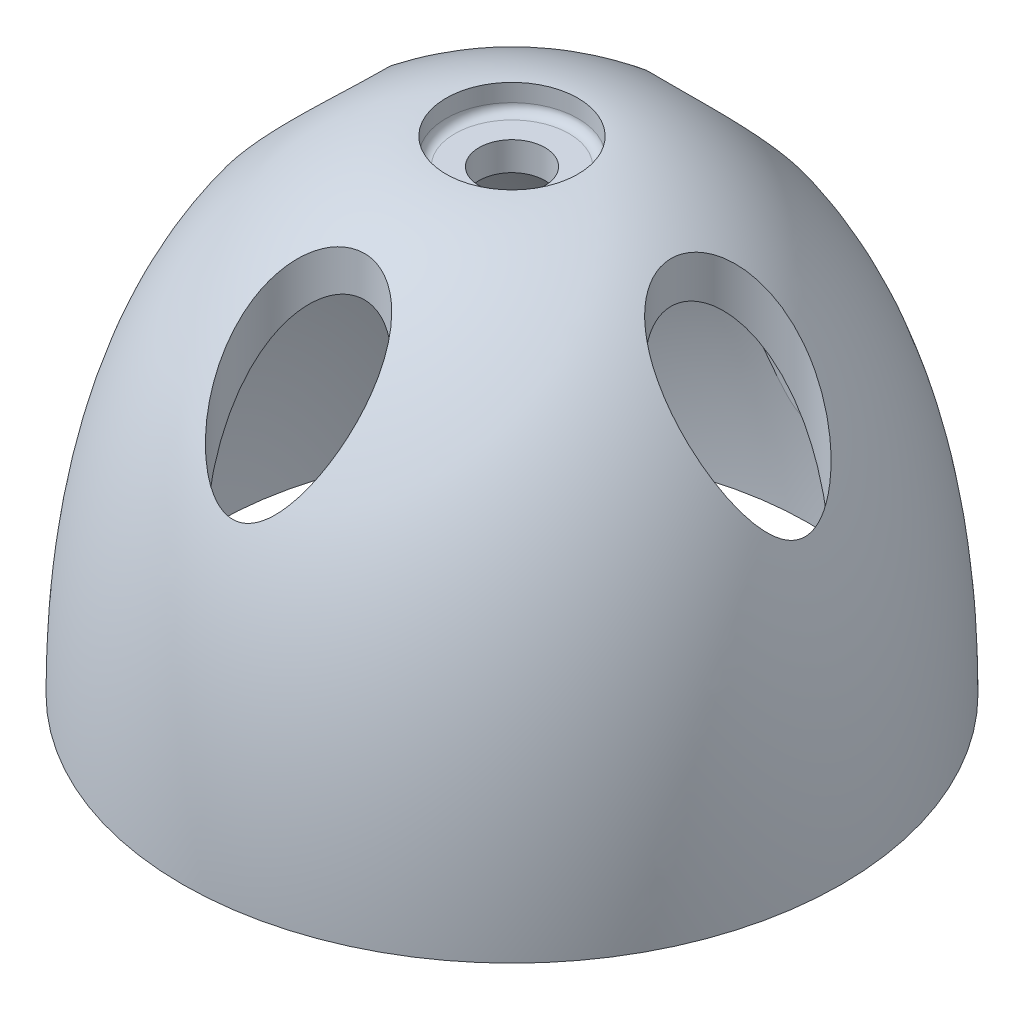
ISO-10303-21;
HEADER;
FILE_DESCRIPTION(('STEP AP214'),'2;1');
FILE_NAME('part.step','',(''),(''),'','','');
FILE_SCHEMA(('AUTOMOTIVE_DESIGN { 1 0 10303 214 1 1 1 1 }'));
ENDSEC;
DATA;
#1=APPLICATION_CONTEXT('core data for automotive mechanical design processes');
#2=APPLICATION_PROTOCOL_DEFINITION('international standard','automotive_design',2000,#1);
#3=PRODUCT_CONTEXT('',#1,'mechanical');
#4=PRODUCT('Part','Part','',(#3));
#5=PRODUCT_RELATED_PRODUCT_CATEGORY('part','',(#4));
#6=PRODUCT_DEFINITION_FORMATION('','',#4);
#7=PRODUCT_DEFINITION_CONTEXT('part definition',#1,'design');
#8=PRODUCT_DEFINITION('design','',#6,#7);
#9=PRODUCT_DEFINITION_SHAPE('','',#8);
#10=(LENGTH_UNIT() NAMED_UNIT(*) SI_UNIT(.MILLI.,.METRE.));
#11=(NAMED_UNIT(*) PLANE_ANGLE_UNIT() SI_UNIT($,.RADIAN.));
#12=(NAMED_UNIT(*) SI_UNIT($,.STERADIAN.) SOLID_ANGLE_UNIT());
#13=UNCERTAINTY_MEASURE_WITH_UNIT(LENGTH_MEASURE(1.E-05),#10,'distance_accuracy_value','');
#14=(GEOMETRIC_REPRESENTATION_CONTEXT(3) GLOBAL_UNCERTAINTY_ASSIGNED_CONTEXT((#13)) GLOBAL_UNIT_ASSIGNED_CONTEXT((#10,
#11,#12)) REPRESENTATION_CONTEXT('',''));
#15=CARTESIAN_POINT('',(0.,0.,0.));
#16=DIRECTION('',(0.,0.,1.));
#17=DIRECTION('',(1.,0.,0.));
#18=AXIS2_PLACEMENT_3D('',#15,#16,#17);
#19=CARTESIAN_POINT('',(15.,0.,0.));
#20=CARTESIAN_POINT('',(15.,16.5706015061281,0.));
#21=CARTESIAN_POINT('',(7.17361649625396,21.7442703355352,0.));
#22=CARTESIAN_POINT('',(2.99999999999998,22.,0.));
#23=B_SPLINE_CURVE_WITH_KNOTS('',3,(#19,#20,#21,#22),.UNSPECIFIED.,.F.,.F.,(4,4),(0.,1.),.UNSPECIFIED.);
#24=CARTESIAN_POINT('',(0.,0.,0.));
#25=DIRECTION('',(0.,-1.,0.));
#26=AXIS1_PLACEMENT('',#24,#25);
#27=SURFACE_OF_REVOLUTION('',#23,#26);
#28=CARTESIAN_POINT('',(-10.,17.1727993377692,-3.28264103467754));
#29=CARTESIAN_POINT('',(-10.1420393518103,16.9894406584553,-3.28264292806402));
#30=CARTESIAN_POINT('',(-10.2820617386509,16.8045029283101,-3.27257664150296));
#31=CARTESIAN_POINT('',(-10.5570647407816,16.4327807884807,-3.23373789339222));
#32=CARTESIAN_POINT('',(-10.6920431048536,16.2459956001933,-3.20495718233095));
#33=CARTESIAN_POINT('',(-10.9560796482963,15.8719624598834,-3.12952685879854));
#34=CARTESIAN_POINT('',(-11.0851398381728,15.6847146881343,-3.08288336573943));
#35=CARTESIAN_POINT('',(-11.3366589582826,15.3111183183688,-2.97192423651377));
#36=CARTESIAN_POINT('',(-11.4591212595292,15.12476930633,-2.9076177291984));
#37=CARTESIAN_POINT('',(-11.6488559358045,14.8292749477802,-2.79027243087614));
#38=CARTESIAN_POINT('',(-11.7184857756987,14.7192730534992,-2.74313213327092));
#39=CARTESIAN_POINT('',(-11.8549459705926,14.5007175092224,-2.64196171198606));
#40=CARTESIAN_POINT('',(-11.9217768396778,14.392163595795,-2.58793286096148));
#41=CARTESIAN_POINT('',(-12.0522963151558,14.1773244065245,-2.47254025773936));
#42=CARTESIAN_POINT('',(-12.1159892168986,14.0710361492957,-2.41118694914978));
#43=CARTESIAN_POINT('',(-12.2399586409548,13.8615453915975,-2.28031836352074));
#44=CARTESIAN_POINT('',(-12.3002365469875,13.7583416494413,-2.21080642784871));
#45=CARTESIAN_POINT('',(-12.3928632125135,13.5979484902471,-2.09296836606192));
#46=CARTESIAN_POINT('',(-12.4265109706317,13.5392762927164,-2.04767303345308));
#47=CARTESIAN_POINT('',(-12.4922566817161,13.4239365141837,-1.95355501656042));
#48=CARTESIAN_POINT('',(-12.52435499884,13.3672684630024,-1.90473316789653));
#49=CARTESIAN_POINT('',(-12.5867707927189,13.2565058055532,-1.80322183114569));
#50=CARTESIAN_POINT('',(-12.6170891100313,13.2024099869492,-1.75053419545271));
#51=CARTESIAN_POINT('',(-12.6756358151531,13.0975476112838,-1.64088708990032));
#52=CARTESIAN_POINT('',(-12.7038649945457,13.0467797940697,-1.58392925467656));
#53=CARTESIAN_POINT('',(-12.767030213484,12.9329731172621,-1.44505057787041));
#54=CARTESIAN_POINT('',(-12.8009747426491,12.8716460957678,-1.36123607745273));
#55=CARTESIAN_POINT('',(-12.8628211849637,12.7603484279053,-1.18430249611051));
#56=CARTESIAN_POINT('',(-12.8907340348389,12.7103572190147,-1.09120071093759));
#57=CARTESIAN_POINT('',(-12.9325138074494,12.6369077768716,-0.919902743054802));
#58=CARTESIAN_POINT('',(-12.9481467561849,12.609948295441,-0.84366450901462));
#59=CARTESIAN_POINT('',(-12.9736630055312,12.5676543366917,-0.687106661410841));
#60=CARTESIAN_POINT('',(-12.9835538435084,12.5523046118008,-0.606792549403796));
#61=CARTESIAN_POINT('',(-12.996798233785,12.5349093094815,-0.443658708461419));
#62=CARTESIAN_POINT('',(-13.0001118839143,12.5329447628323,-0.360826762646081));
#63=CARTESIAN_POINT('',(-12.9998821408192,12.542801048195,-0.195987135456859));
#64=CARTESIAN_POINT('',(-12.9963354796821,12.5546284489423,-0.113979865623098));
#65=CARTESIAN_POINT('',(-12.9834934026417,12.5891835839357,0.0403109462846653));
#66=CARTESIAN_POINT('',(-12.9746729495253,12.6109790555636,0.112851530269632));
#67=CARTESIAN_POINT('',(-12.9524855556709,12.6632023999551,0.25395655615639));
#68=CARTESIAN_POINT('',(-12.939117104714,12.6936331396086,0.322519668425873));
#69=CARTESIAN_POINT('',(-12.8970838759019,12.7869160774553,0.505551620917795));
#70=CARTESIAN_POINT('',(-12.864498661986,12.8568782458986,0.615503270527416));
#71=CARTESIAN_POINT('',(-12.8095305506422,12.9716801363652,0.770719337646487));
#72=CARTESIAN_POINT('',(-12.7901440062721,13.011688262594,0.820937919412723));
#73=CARTESIAN_POINT('',(-12.7496063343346,13.0943834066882,0.918376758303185));
#74=CARTESIAN_POINT('',(-12.7284555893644,13.137069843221,0.965597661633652));
#75=CARTESIAN_POINT('',(-12.6656783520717,13.2624136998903,1.09690813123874));
#76=CARTESIAN_POINT('',(-12.6221624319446,13.3477141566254,1.17756675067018));
#77=CARTESIAN_POINT('',(-12.5308776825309,13.523339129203,1.33061462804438));
#78=CARTESIAN_POINT('',(-12.4831051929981,13.6136679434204,1.40299664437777));
#79=CARTESIAN_POINT('',(-12.3839142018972,13.7979271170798,1.54058466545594));
#80=CARTESIAN_POINT('',(-12.3324906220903,13.8918624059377,1.60578034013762));
#81=CARTESIAN_POINT('',(-12.2264796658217,14.0822231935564,1.72967981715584));
#82=CARTESIAN_POINT('',(-12.1718912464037,14.1786495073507,1.78838146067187));
#83=CARTESIAN_POINT('',(-12.0662209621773,14.3622166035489,1.89351034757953));
#84=CARTESIAN_POINT('',(-12.0154437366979,14.4491699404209,1.94057459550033));
#85=CARTESIAN_POINT('',(-11.9117991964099,14.6241006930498,2.03030503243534));
#86=CARTESIAN_POINT('',(-11.8589316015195,14.7120782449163,2.07297062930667));
#87=CARTESIAN_POINT('',(-11.6973246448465,14.9771918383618,2.19471968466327));
#88=CARTESIAN_POINT('',(-11.5856185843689,15.1554435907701,2.26751865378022));
#89=CARTESIAN_POINT('',(-11.3548866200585,15.5134342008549,2.39724986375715));
#90=CARTESIAN_POINT('',(-11.2358473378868,15.6931752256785,2.45415199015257));
#91=CARTESIAN_POINT('',(-10.9912567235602,16.0525202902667,2.55192192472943));
#92=CARTESIAN_POINT('',(-10.8657072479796,16.2321243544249,2.59279427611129));
#93=CARTESIAN_POINT('',(-10.6046266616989,16.5957694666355,2.65897923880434));
#94=CARTESIAN_POINT('',(-10.4689056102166,16.7797717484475,2.68376032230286));
#95=CARTESIAN_POINT('',(-10.1919174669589,17.145316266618,2.71445598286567));
#96=CARTESIAN_POINT('',(-10.050648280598,17.3268575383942,2.72036336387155));
#97=CARTESIAN_POINT('',(-9.76425166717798,17.6853102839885,2.71149874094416));
#98=CARTESIAN_POINT('',(-9.61914089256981,17.8622366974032,2.69680502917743));
#99=CARTESIAN_POINT('',(-9.32625698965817,18.2102263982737,2.6445036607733));
#100=CARTESIAN_POINT('',(-9.17848676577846,18.3812955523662,2.60691968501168));
#101=CARTESIAN_POINT('',(-8.87989635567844,18.7182823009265,2.50495702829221));
#102=CARTESIAN_POINT('',(-8.72906784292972,18.8840584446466,2.44012345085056));
#103=CARTESIAN_POINT('',(-8.43080882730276,19.2035790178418,2.27982858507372));
#104=CARTESIAN_POINT('',(-8.28337500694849,19.3573355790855,2.18439868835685));
#105=CARTESIAN_POINT('',(-8.02664260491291,19.6183812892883,1.98163756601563));
#106=CARTESIAN_POINT('',(-7.91563498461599,19.7287987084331,1.88055318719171));
#107=CARTESIAN_POINT('',(-7.70428631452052,19.9347706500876,1.65476357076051));
#108=CARTESIAN_POINT('',(-7.60392968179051,20.0303469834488,1.5300936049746));
#109=CARTESIAN_POINT('',(-7.44027882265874,20.1829892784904,1.28714944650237));
#110=CARTESIAN_POINT('',(-7.3736957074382,20.243897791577,1.17355336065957));
#111=CARTESIAN_POINT('',(-7.28403873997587,20.3244552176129,0.993318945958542));
#112=CARTESIAN_POINT('',(-7.2558484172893,20.3495132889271,0.931578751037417));
#113=CARTESIAN_POINT('',(-7.20330234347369,20.3957263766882,0.805092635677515));
#114=CARTESIAN_POINT('',(-7.17894492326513,20.4168830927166,0.740348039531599));
#115=CARTESIAN_POINT('',(-7.13429777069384,20.4551627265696,0.607689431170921));
#116=CARTESIAN_POINT('',(-7.11404202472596,20.472252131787,0.539754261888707));
#117=CARTESIAN_POINT('',(-7.07823250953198,20.5019154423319,0.40172340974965));
#118=CARTESIAN_POINT('',(-7.06267643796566,20.5144915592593,0.331628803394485));
#119=CARTESIAN_POINT('',(-7.0365655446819,20.534935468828,0.189852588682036));
#120=CARTESIAN_POINT('',(-7.02600955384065,20.5428043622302,0.118171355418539));
#121=CARTESIAN_POINT('',(-7.01010569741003,20.5537063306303,-0.0261264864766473));
#122=CARTESIAN_POINT('',(-7.00475720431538,20.556739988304,-0.0987429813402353));
#123=CARTESIAN_POINT('',(-6.99968882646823,20.557849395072,-0.235433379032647));
#124=CARTESIAN_POINT('',(-6.99936789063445,20.5564789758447,-0.29948129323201));
#125=CARTESIAN_POINT('',(-7.00280554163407,20.5499838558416,-0.427282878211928));
#126=CARTESIAN_POINT('',(-7.00656546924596,20.5448579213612,-0.491036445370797));
#127=CARTESIAN_POINT('',(-7.02386598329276,20.5239287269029,-0.681065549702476));
#128=CARTESIAN_POINT('',(-7.04342162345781,20.5025751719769,-0.806271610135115));
#129=CARTESIAN_POINT('',(-7.09672933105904,20.446561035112,-1.04826275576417));
#130=CARTESIAN_POINT('',(-7.13025874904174,20.4121098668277,-1.16514764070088));
#131=CARTESIAN_POINT('',(-7.20944476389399,20.3313672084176,-1.39037152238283));
#132=CARTESIAN_POINT('',(-7.25510618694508,20.2850710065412,-1.4987070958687));
#133=CARTESIAN_POINT('',(-7.37528777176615,20.1630204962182,-1.74410669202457));
#134=CARTESIAN_POINT('',(-7.45421396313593,20.0827247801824,-1.87675961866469));
#135=CARTESIAN_POINT('',(-7.62529530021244,19.9070125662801,-2.12200046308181));
#136=CARTESIAN_POINT('',(-7.71747572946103,19.811567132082,-2.23454908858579));
#137=CARTESIAN_POINT('',(-7.94724047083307,19.5706272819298,-2.47900849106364));
#138=CARTESIAN_POINT('',(-8.08876461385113,19.4198991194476,-2.60201737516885));
#139=CARTESIAN_POINT('',(-8.37996497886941,19.1033485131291,-2.81405118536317));
#140=CARTESIAN_POINT('',(-8.52965374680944,18.9375025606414,-2.9030220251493));
#141=CARTESIAN_POINT('',(-8.79078400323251,18.6418618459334,-3.03087650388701));
#142=CARTESIAN_POINT('',(-8.90160933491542,18.5144618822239,-3.07679913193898));
#143=CARTESIAN_POINT('',(-9.1233933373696,18.2553616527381,-3.15411490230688));
#144=CARTESIAN_POINT('',(-9.23435204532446,18.1236595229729,-3.18550165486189));
#145=CARTESIAN_POINT('',(-9.45549199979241,17.8567990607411,-3.23499103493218));
#146=CARTESIAN_POINT('',(-9.56567156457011,17.7216351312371,-3.25307053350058));
#147=CARTESIAN_POINT('',(-9.7842842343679,17.4488807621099,-3.27689447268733));
#148=CARTESIAN_POINT('',(-9.89271743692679,17.3112904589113,-3.28263960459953));
#149=CARTESIAN_POINT('',(-10.,17.1727993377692,-3.28264103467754));
#150=B_SPLINE_CURVE_WITH_KNOTS('',3,(#28,#29,#30,#31,#32,#33,#34,#35,#36,#37,#38,#39,#40,#41,
#42,#43,#44,#45,#46,#47,#48,#49,#50,#51,#52,#53,#54,#55,#56,#57,#58,#59,#60,#61,#62,#63,#64,#65,
#66,#67,#68,#69,#70,#71,#72,#73,#74,#75,#76,#77,#78,#79,#80,#81,#82,#83,#84,#85,#86,#87,#88,#89,
#90,#91,#92,#93,#94,#95,#96,#97,#98,#99,#100,#101,#102,#103,#104,#105,#106,#107,#108,#109,#110,
#111,#112,#113,#114,#115,#116,#117,#118,#119,#120,#121,#122,#123,#124,#125,#126,#127,#128,#129,
#130,#131,#132,#133,#134,#135,#136,#137,#138,#139,#140,#141,#142,#143,#144,#145,#146,#147,#148,
#149),.UNSPECIFIED.,.T.,.F.,(4,2,2,2,2,2,2,2,2,2,2,2,2,2,2,2,2,2,2,2,2,2,2,2,2,2,2,2,2,2,2,2,2,
2,2,2,2,2,2,2,2,2,2,2,2,2,2,2,2,2,2,2,2,2,2,2,2,2,2,2,4),(0.,0.695645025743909,1.39159690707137,
2.08731058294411,2.78266536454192,3.19787056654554,3.61299917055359,4.02754277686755,
4.44191719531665,4.68602827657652,4.93008170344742,5.17401893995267,5.41786326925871,
5.74478134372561,6.07110157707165,6.31724661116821,6.56306780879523,6.81037583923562,
7.05780170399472,7.28573283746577,7.51373973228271,7.91426039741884,8.11539660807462,
8.31648931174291,8.6914844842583,9.06680528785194,9.44265875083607,9.81863678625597,
10.1519662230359,10.4853404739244,11.1523393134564,11.8205932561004,12.4886576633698,
13.1777970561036,13.8671991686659,14.5539883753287,15.2400682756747,15.9380872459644,
16.6353923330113,17.1925499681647,17.7488808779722,18.1822333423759,18.3990527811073,
18.6157775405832,18.8342305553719,19.0525763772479,19.2708711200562,19.489139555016,
19.6810832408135,19.8730900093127,20.2566233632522,20.6342662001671,21.0120594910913,
21.5311618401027,22.0512678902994,22.7690730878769,23.488014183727,24.0123256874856,
24.5368674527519,25.0623187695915,25.5877406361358),.UNSPECIFIED.);
#151=CARTESIAN_POINT('',(-10.,17.1727993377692,-3.28264103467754));
#152=VERTEX_POINT('',#151);
#153=EDGE_CURVE('E171',#152,#152,#150,.T.);
#154=ORIENTED_EDGE('',*,*,#153,.F.);
#155=EDGE_LOOP('',(#154));
#156=FACE_BOUND('',#155,.T.);
#157=CARTESIAN_POINT('',(10.,17.1727993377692,-3.28264103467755));
#158=CARTESIAN_POINT('',(9.87995642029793,17.3277642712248,-3.28263884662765));
#159=CARTESIAN_POINT('',(9.75847222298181,17.481599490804,-3.2754488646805));
#160=CARTESIAN_POINT('',(9.51339437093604,17.7861504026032,-3.245487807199));
#161=CARTESIAN_POINT('',(9.38980033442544,17.9368655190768,-3.22271388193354));
#162=CARTESIAN_POINT('',(9.14216498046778,18.2333733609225,-3.16020296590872));
#163=CARTESIAN_POINT('',(9.01812747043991,18.3791834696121,-3.12053467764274));
#164=CARTESIAN_POINT('',(8.77079379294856,18.6648919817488,-3.02248267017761));
#165=CARTESIAN_POINT('',(8.64749706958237,18.8047954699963,-2.9641154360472));
#166=CARTESIAN_POINT('',(8.39521041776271,19.0863663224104,-2.82175271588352));
#167=CARTESIAN_POINT('',(8.26642689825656,19.2274704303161,-2.73624807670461));
#168=CARTESIAN_POINT('',(8.01619599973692,19.4972631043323,-2.53871631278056));
#169=CARTESIAN_POINT('',(7.89474241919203,19.6259622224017,-2.4267120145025));
#170=CARTESIAN_POINT('',(7.68661328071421,19.8436080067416,-2.19770881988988));
#171=CARTESIAN_POINT('',(7.59768524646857,19.9354848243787,-2.08557772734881));
#172=CARTESIAN_POINT('',(7.43295462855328,20.1044054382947,-1.84206365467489));
#173=CARTESIAN_POINT('',(7.35713439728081,20.1814691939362,-1.71070700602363));
#174=CARTESIAN_POINT('',(7.23648040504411,20.3039714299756,-1.45685650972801));
#175=CARTESIAN_POINT('',(7.18849591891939,20.3526371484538,-1.33742842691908));
#176=CARTESIAN_POINT('',(7.10740744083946,20.4355617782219,-1.08884304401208));
#177=CARTESIAN_POINT('',(7.07429623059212,20.4698276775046,-0.959690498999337));
#178=CARTESIAN_POINT('',(7.02528589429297,20.522305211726,-0.694200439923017));
#179=CARTESIAN_POINT('',(7.00947877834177,20.5404309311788,-0.557828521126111));
#180=CARTESIAN_POINT('',(6.99685227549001,20.5592295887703,-0.283012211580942));
#181=CARTESIAN_POINT('',(7.00002707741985,20.5599078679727,-0.144568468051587));
#182=CARTESIAN_POINT('',(7.02412291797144,20.5445203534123,0.11721074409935));
#183=CARTESIAN_POINT('',(7.04343094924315,20.5299470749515,0.240789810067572));
#184=CARTESIAN_POINT('',(7.09652152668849,20.4870604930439,0.482277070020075));
#185=CARTESIAN_POINT('',(7.13030379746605,20.4587474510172,0.600185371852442));
#186=CARTESIAN_POINT('',(7.2114053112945,20.3888204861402,0.830466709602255));
#187=CARTESIAN_POINT('',(7.25903159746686,20.3469020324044,0.94263746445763));
#188=CARTESIAN_POINT('',(7.3650325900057,20.2517031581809,1.15653428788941));
#189=CARTESIAN_POINT('',(7.423412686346,20.1984170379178,1.25825507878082));
#190=CARTESIAN_POINT('',(7.57613259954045,20.0565830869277,1.49278519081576));
#191=CARTESIAN_POINT('',(7.67498053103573,19.9628451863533,1.61953575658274));
#192=CARTESIAN_POINT('',(7.88381433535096,19.7601742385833,1.8494971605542));
#193=CARTESIAN_POINT('',(7.99382339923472,19.6512093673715,1.95265747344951));
#194=CARTESIAN_POINT('',(8.26640929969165,19.3751782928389,2.17435990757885));
#195=CARTESIAN_POINT('',(8.43215374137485,19.2025185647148,2.28206551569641));
#196=CARTESIAN_POINT('',(8.6835499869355,18.9325929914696,2.41475853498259));
#197=CARTESIAN_POINT('',(8.76791675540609,18.8406761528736,2.45420911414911));
#198=CARTESIAN_POINT('',(8.93695719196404,18.6537719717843,2.52418957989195));
#199=CARTESIAN_POINT('',(9.02163078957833,18.5587852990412,2.5547213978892));
#200=CARTESIAN_POINT('',(9.22982932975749,18.3217500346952,2.61970891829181));
#201=CARTESIAN_POINT('',(9.35319688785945,18.1782679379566,2.6494398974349));
#202=CARTESIAN_POINT('',(9.59802141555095,17.8872783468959,2.69290504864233));
#203=CARTESIAN_POINT('',(9.71947746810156,17.7397690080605,2.70663176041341));
#204=CARTESIAN_POINT('',(9.95966349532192,17.4416193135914,2.71950081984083));
#205=CARTESIAN_POINT('',(10.0783894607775,17.2909749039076,2.71862293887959));
#206=CARTESIAN_POINT('',(10.3122266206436,16.987646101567,2.70336641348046));
#207=CARTESIAN_POINT('',(10.427338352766,16.8349620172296,2.68898978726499));
#208=CARTESIAN_POINT('',(10.6576975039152,16.5225040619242,2.64680567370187));
#209=CARTESIAN_POINT('',(10.7727869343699,16.3626796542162,2.61851300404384));
#210=CARTESIAN_POINT('',(10.9980665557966,16.0423794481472,2.54892486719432));
#211=CARTESIAN_POINT('',(11.1082559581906,15.8819035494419,2.50762731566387));
#212=CARTESIAN_POINT('',(11.3231330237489,15.5613812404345,2.41237526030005));
#213=CARTESIAN_POINT('',(11.427828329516,15.4013345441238,2.35843894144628));
#214=CARTESIAN_POINT('',(11.6314254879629,15.0824260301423,2.23776773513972));
#215=CARTESIAN_POINT('',(11.7303292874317,14.9235638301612,2.17103718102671));
#216=CARTESIAN_POINT('',(11.884802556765,14.6692182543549,2.05252285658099));
#217=CARTESIAN_POINT('',(11.9423480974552,14.5729668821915,2.00492849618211));
#218=CARTESIAN_POINT('',(12.0548919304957,14.3817805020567,1.90439245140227));
#219=CARTESIAN_POINT('',(12.109890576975,14.2868453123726,1.85145151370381));
#220=CARTESIAN_POINT('',(12.2171452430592,14.0987688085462,1.73979874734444));
#221=CARTESIAN_POINT('',(12.2694002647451,14.0056281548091,1.68108484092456));
#222=CARTESIAN_POINT('',(12.3708352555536,13.8219019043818,1.5573436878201));
#223=CARTESIAN_POINT('',(12.4200159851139,13.7313156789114,1.49231801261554));
#224=CARTESIAN_POINT('',(12.5016799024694,13.5784074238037,1.37422883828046));
#225=CARTESIAN_POINT('',(12.5350056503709,13.5152256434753,1.32286182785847));
#226=CARTESIAN_POINT('',(12.5995764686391,13.3912961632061,1.21605752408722));
#227=CARTESIAN_POINT('',(12.6308220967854,13.3305478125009,1.16062133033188));
#228=CARTESIAN_POINT('',(12.6908617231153,13.2123184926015,1.04532039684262));
#229=CARTESIAN_POINT('',(12.7196598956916,13.1548320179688,0.985463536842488));
#230=CARTESIAN_POINT('',(12.7743884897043,13.0440893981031,0.860775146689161));
#231=CARTESIAN_POINT('',(12.8003208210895,12.9908304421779,0.795946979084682));
#232=CARTESIAN_POINT('',(12.8519328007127,12.8832057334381,0.651759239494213));
#233=CARTESIAN_POINT('',(12.8771189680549,12.82963698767,0.571614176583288));
#234=CARTESIAN_POINT('',(12.9216910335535,12.7327314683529,0.40381872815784));
#235=CARTESIAN_POINT('',(12.941084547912,12.6893812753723,0.316178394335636));
#236=CARTESIAN_POINT('',(12.969574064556,12.6232975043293,0.15023410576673));
#237=CARTESIAN_POINT('',(12.9798932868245,12.5982604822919,0.0730759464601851));
#238=CARTESIAN_POINT('',(12.9945038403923,12.5599829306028,-0.0846622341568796));
#239=CARTESIAN_POINT('',(12.998802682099,12.5467277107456,-0.165237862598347));
#240=CARTESIAN_POINT('',(13.0007647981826,12.5335004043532,-0.32800176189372));
#241=CARTESIAN_POINT('',(12.9983947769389,12.5335950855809,-0.410196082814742));
#242=CARTESIAN_POINT('',(12.9870330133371,12.547220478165,-0.573002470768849));
#243=CARTESIAN_POINT('',(12.978036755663,12.5607603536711,-0.653613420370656));
#244=CARTESIAN_POINT('',(12.9522995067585,12.602785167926,-0.823410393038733));
#245=CARTESIAN_POINT('',(12.9345569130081,12.6332988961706,-0.911930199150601));
#246=CARTESIAN_POINT('',(12.8928447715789,12.7066644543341,-1.08212398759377));
#247=CARTESIAN_POINT('',(12.8688630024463,12.7495405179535,-1.16378411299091));
#248=CARTESIAN_POINT('',(12.8215812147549,12.8345301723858,-1.30389914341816));
#249=CARTESIAN_POINT('',(12.799149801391,12.8749972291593,-1.36367875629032));
#250=CARTESIAN_POINT('',(12.7518359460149,12.9603399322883,-1.47900473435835));
#251=CARTESIAN_POINT('',(12.7269519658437,13.0052183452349,-1.53454840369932));
#252=CARTESIAN_POINT('',(12.6751246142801,13.0984415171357,-1.64178108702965));
#253=CARTESIAN_POINT('',(12.6481776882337,13.1467922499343,-1.69346312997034));
#254=CARTESIAN_POINT('',(12.5925637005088,13.2461615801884,-1.79322779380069));
#255=CARTESIAN_POINT('',(12.5638959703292,13.297181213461,-1.8413089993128));
#256=CARTESIAN_POINT('',(12.477985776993,13.4492667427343,-1.97697434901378));
#257=CARTESIAN_POINT('',(12.4187448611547,13.5531451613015,-2.06015274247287));
#258=CARTESIAN_POINT('',(12.2958613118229,13.7659039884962,-2.21625969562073));
#259=CARTESIAN_POINT('',(12.2322148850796,13.8747886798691,-2.28917925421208));
#260=CARTESIAN_POINT('',(12.1010350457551,14.0961188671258,-2.4261564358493));
#261=CARTESIAN_POINT('',(12.0334935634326,14.2085715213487,-2.4901946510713));
#262=CARTESIAN_POINT('',(11.8950436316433,14.4357525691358,-2.61012826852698));
#263=CARTESIAN_POINT('',(11.8241341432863,14.5504816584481,-2.66602113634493));
#264=CARTESIAN_POINT('',(11.6870528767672,14.7689934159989,-2.76461383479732));
#265=CARTESIAN_POINT('',(11.6211928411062,14.8726248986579,-2.80808618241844));
#266=CARTESIAN_POINT('',(11.4871866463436,15.0806779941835,-2.88924976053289));
#267=CARTESIAN_POINT('',(11.4190401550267,15.1850997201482,-2.92694014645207));
#268=CARTESIAN_POINT('',(11.2112813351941,15.4991849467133,-3.0316214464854));
#269=CARTESIAN_POINT('',(11.0684109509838,15.7095705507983,-3.09017894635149));
#270=CARTESIAN_POINT('',(10.7749633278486,16.1301727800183,-3.18491671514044));
#271=CARTESIAN_POINT('',(10.6243806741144,16.3403891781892,-3.22108102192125));
#272=CARTESIAN_POINT('',(10.3167115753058,16.7586684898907,-3.26993689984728));
#273=CARTESIAN_POINT('',(10.1596294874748,16.9667327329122,-3.28264394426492));
#274=CARTESIAN_POINT('',(10.,17.1727993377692,-3.28264103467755));
#275=B_SPLINE_CURVE_WITH_KNOTS('',3,(#157,#158,#159,#160,#161,#162,#163,#164,#165,#166,#167,
#168,#169,#170,#171,#172,#173,#174,#175,#176,#177,#178,#179,#180,#181,#182,#183,#184,#185,#186,
#187,#188,#189,#190,#191,#192,#193,#194,#195,#196,#197,#198,#199,#200,#201,#202,#203,#204,#205,
#206,#207,#208,#209,#210,#211,#212,#213,#214,#215,#216,#217,#218,#219,#220,#221,#222,#223,#224,
#225,#226,#227,#228,#229,#230,#231,#232,#233,#234,#235,#236,#237,#238,#239,#240,#241,#242,#243,
#244,#245,#246,#247,#248,#249,#250,#251,#252,#253,#254,#255,#256,#257,#258,#259,#260,#261,#262,
#263,#264,#265,#266,#267,#268,#269,#270,#271,#272,#273,#274),.UNSPECIFIED.,.T.,.F.,(4,2,2,2,2,2,
2,2,2,2,2,2,2,2,2,2,2,2,2,2,2,2,2,2,2,2,2,2,2,2,2,2,2,2,2,2,2,2,2,2,2,2,2,2,2,2,2,2,2,2,2,2,2,2,
2,2,2,2,4),(0.,0.587882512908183,1.17587255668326,1.7614939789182,2.34660052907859,
2.9727039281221,3.5982699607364,4.10662670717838,4.61429360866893,5.02540836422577,
5.43632338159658,5.84941287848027,6.26237591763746,6.6383948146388,7.01440655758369,
7.39949354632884,7.78477407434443,8.33987151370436,8.89614694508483,9.67889545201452,
10.0712293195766,10.463478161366,11.0372803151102,11.6113498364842,12.1862145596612,
12.7609933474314,13.3574074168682,13.953917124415,14.5495737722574,15.1450290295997,
15.5103736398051,15.8756672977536,16.2410929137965,16.6064277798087,16.8702519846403,
17.1340051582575,17.3972990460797,17.6604163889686,17.9585708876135,18.2563316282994,
18.5006728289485,18.7447089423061,18.9899656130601,19.235389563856,19.5197166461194,
19.804604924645,20.0310746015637,20.2576872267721,20.4846995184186,20.711800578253,
21.1480779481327,21.5847357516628,22.0223332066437,22.4600665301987,22.8506769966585,
23.2413444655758,24.0230483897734,24.8053088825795,25.5870531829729),.UNSPECIFIED.);
#276=CARTESIAN_POINT('',(10.,17.1727993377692,-3.28264103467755));
#277=VERTEX_POINT('',#276);
#278=EDGE_CURVE('E88',#277,#277,#275,.T.);
#279=ORIENTED_EDGE('',*,*,#278,.F.);
#280=EDGE_LOOP('',(#279));
#281=FACE_BOUND('',#280,.T.);
#282=CARTESIAN_POINT('',(0.,22.,0.));
#283=DIRECTION('',(0.,-1.,0.));
#284=DIRECTION('',(0.,0.,-1.));
#285=AXIS2_PLACEMENT_3D('',#282,#283,#284);
#286=CIRCLE('',#285,2.99999999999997);
#287=CARTESIAN_POINT('',(0.,22.,-2.99999999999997));
#288=VERTEX_POINT('',#287);
#289=EDGE_CURVE('E113',#288,#288,#286,.T.);
#290=ORIENTED_EDGE('',*,*,#289,.T.);
#291=EDGE_LOOP('',(#290));
#292=FACE_BOUND('',#291,.T.);
#293=CARTESIAN_POINT('',(0.,0.,0.));
#294=DIRECTION('',(0.,-1.,0.));
#295=DIRECTION('',(0.,0.,-1.));
#296=AXIS2_PLACEMENT_3D('',#293,#294,#295);
#297=CIRCLE('',#296,15.);
#298=CARTESIAN_POINT('',(0.,0.,-15.));
#299=VERTEX_POINT('',#298);
#300=EDGE_CURVE('E10',#299,#299,#297,.T.);
#301=ORIENTED_EDGE('',*,*,#300,.F.);
#302=EDGE_LOOP('',(#301));
#303=FACE_BOUND('',#302,.T.);
#304=CARTESIAN_POINT('',(0.,11.7654946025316,-13.282641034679));
#305=CARTESIAN_POINT('',(-0.0765189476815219,11.7654934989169,-13.2826414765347));
#306=CARTESIAN_POINT('',(-0.153034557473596,11.7721757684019,-13.2796812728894));
#307=CARTESIAN_POINT('',(-0.303512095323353,11.7979935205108,-13.2682060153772));
#308=CARTESIAN_POINT('',(-0.377470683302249,11.8171446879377,-13.2596839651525));
#309=CARTESIAN_POINT('',(-0.540708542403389,11.8724217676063,-13.234960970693));
#310=CARTESIAN_POINT('',(-0.628657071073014,11.9117547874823,-13.2172986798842));
#311=CARTESIAN_POINT('',(-0.796657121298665,12.0024114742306,-13.1762318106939));
#312=CARTESIAN_POINT('',(-0.876689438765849,12.0537633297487,-13.1528137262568));
#313=CARTESIAN_POINT('',(-1.01904940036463,12.1573100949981,-13.1051207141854));
#314=CARTESIAN_POINT('',(-1.08231624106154,12.2084851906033,-13.081373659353));
#315=CARTESIAN_POINT('',(-1.20381430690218,12.3154023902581,-13.031304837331));
#316=CARTESIAN_POINT('',(-1.26204154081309,12.3711480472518,-13.0049810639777));
#317=CARTESIAN_POINT('',(-1.37409336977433,12.4860936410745,-12.9501797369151));
#318=CARTESIAN_POINT('',(-1.4279096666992,12.5452997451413,-12.9216983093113));
#319=CARTESIAN_POINT('',(-1.53155976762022,12.6662693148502,-12.8629266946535));
#320=CARTESIAN_POINT('',(-1.58139201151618,12.7280337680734,-12.8326358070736));
#321=CARTESIAN_POINT('',(-1.67931993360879,12.8559044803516,-12.7692882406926));
#322=CARTESIAN_POINT('',(-1.72727638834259,12.922086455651,-12.736170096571));
#323=CARTESIAN_POINT('',(-1.81972769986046,13.0560742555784,-12.6684055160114));
#324=CARTESIAN_POINT('',(-1.86422183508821,13.1238804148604,-12.6337587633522));
#325=CARTESIAN_POINT('',(-1.9930418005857,13.3292710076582,-12.5276787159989));
#326=CARTESIAN_POINT('',(-2.07264577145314,13.4687479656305,-12.4541449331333));
#327=CARTESIAN_POINT('',(-2.22109823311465,13.7510127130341,-12.3020514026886));
#328=CARTESIAN_POINT('',(-2.28992458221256,13.8938066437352,-12.2234817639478));
#329=CARTESIAN_POINT('',(-2.41765769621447,14.1812926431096,-12.0618364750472));
#330=CARTESIAN_POINT('',(-2.47656212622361,14.3259851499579,-11.9787597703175));
#331=CARTESIAN_POINT('',(-2.61048925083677,14.6846440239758,-11.7683732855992));
#332=CARTESIAN_POINT('',(-2.6800837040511,14.8992204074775,-11.6386185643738));
#333=CARTESIAN_POINT('',(-2.79957219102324,15.3287553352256,-11.3707116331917));
#334=CARTESIAN_POINT('',(-2.84945529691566,15.5437140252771,-11.2325548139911));
#335=CARTESIAN_POINT('',(-2.92879308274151,15.9720350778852,-10.948847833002));
#336=CARTESIAN_POINT('',(-2.95828035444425,16.1853994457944,-10.8033098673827));
#337=CARTESIAN_POINT('',(-2.99546002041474,16.6092822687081,-10.5055954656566));
#338=CARTESIAN_POINT('',(-3.00316630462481,16.8198024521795,-10.3534233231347));
#339=CARTESIAN_POINT('',(-2.99605684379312,17.1605862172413,-10.100018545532));
#340=CARTESIAN_POINT('',(-2.98840971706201,17.2922060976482,-10.0003766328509));
#341=CARTESIAN_POINT('',(-2.96255459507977,17.5530644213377,-9.79938355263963));
#342=CARTESIAN_POINT('',(-2.94434932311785,17.6823034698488,-9.69803283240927));
#343=CARTESIAN_POINT('',(-2.8964606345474,17.9376237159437,-9.4943184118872));
#344=CARTESIAN_POINT('',(-2.86678994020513,18.0637082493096,-9.3919559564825));
#345=CARTESIAN_POINT('',(-2.79487259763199,18.3119678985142,-9.18697838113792));
#346=CARTESIAN_POINT('',(-2.75263020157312,18.4341443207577,-9.08436335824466));
#347=CARTESIAN_POINT('',(-2.63404846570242,18.7228740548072,-8.83783452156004));
#348=CARTESIAN_POINT('',(-2.55083103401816,18.8870171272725,-8.69428916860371));
#349=CARTESIAN_POINT('',(-2.3527926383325,19.2011212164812,-8.41346848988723));
#350=CARTESIAN_POINT('',(-2.23801754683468,19.3511023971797,-8.27618439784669));
#351=CARTESIAN_POINT('',(-2.00893609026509,19.5927659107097,-8.05047494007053));
#352=CARTESIAN_POINT('',(-1.90287968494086,19.6892518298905,-7.95886959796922));
#353=CARTESIAN_POINT('',(-1.67115935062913,19.8678083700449,-7.78705098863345));
#354=CARTESIAN_POINT('',(-1.5455230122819,19.9498989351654,-7.70682198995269));
#355=CARTESIAN_POINT('',(-1.30106132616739,20.0816452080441,-7.57662051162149));
#356=CARTESIAN_POINT('',(-1.18551746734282,20.1345012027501,-7.52379586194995));
#357=CARTESIAN_POINT('',(-1.0042155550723,20.2028902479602,-7.45496567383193));
#358=CARTESIAN_POINT('',(-0.942428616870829,20.2238759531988,-7.43375140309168));
#359=CARTESIAN_POINT('',(-0.816515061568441,20.2619466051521,-7.39514529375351));
#360=CARTESIAN_POINT('',(-0.752389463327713,20.279033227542,-7.37775181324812));
#361=CARTESIAN_POINT('',(-0.621747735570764,20.3091655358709,-7.34700397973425));
#362=CARTESIAN_POINT('',(-0.555218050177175,20.3221822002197,-7.33367865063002));
#363=CARTESIAN_POINT('',(-0.420738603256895,20.343802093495,-7.31150978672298));
#364=CARTESIAN_POINT('',(-0.352789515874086,20.352407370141,-7.30266417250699));
#365=CARTESIAN_POINT('',(-0.216026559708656,20.3650666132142,-7.28964139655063));
#366=CARTESIAN_POINT('',(-0.14721279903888,20.369121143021,-7.28546365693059));
#367=CARTESIAN_POINT('',(-0.00936740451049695,20.3726165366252,-7.28186187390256));
#368=CARTESIAN_POINT('',(0.0596642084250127,20.3720578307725,-7.28243738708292));
#369=CARTESIAN_POINT('',(0.251395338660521,20.3640644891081,-7.29067350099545));
#370=CARTESIAN_POINT('',(0.373734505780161,20.3515819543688,-7.30353566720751));
#371=CARTESIAN_POINT('',(0.613623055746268,20.3125582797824,-7.34354354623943));
#372=CARTESIAN_POINT('',(0.731172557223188,20.2860174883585,-7.37068890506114));
#373=CARTESIAN_POINT('',(0.960463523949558,20.2197210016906,-7.43799954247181));
#374=CARTESIAN_POINT('',(1.07209897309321,20.17978322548,-7.47834401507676));
#375=CARTESIAN_POINT('',(1.28588285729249,20.0885223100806,-7.56969945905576));
#376=CARTESIAN_POINT('',(1.38802685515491,20.0371938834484,-7.620715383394));
#377=CARTESIAN_POINT('',(1.62559544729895,19.8995979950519,-7.75606097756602));
#378=CARTESIAN_POINT('',(1.75529664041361,19.808004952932,-7.84504777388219));
#379=CARTESIAN_POINT('',(1.99248030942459,19.6094548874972,-8.03470674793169));
#380=CARTESIAN_POINT('',(2.099912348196,19.5024638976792,-8.13540466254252));
#381=CARTESIAN_POINT('',(2.33513848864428,19.2288859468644,-8.38834102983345));
#382=CARTESIAN_POINT('',(2.45207809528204,19.0563417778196,-8.54424589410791));
#383=CARTESIAN_POINT('',(2.59932954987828,18.7862525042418,-8.78191136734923));
#384=CARTESIAN_POINT('',(2.64375351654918,18.694237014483,-8.86185747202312));
#385=CARTESIAN_POINT('',(2.72393131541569,18.5070306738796,-9.02238756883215));
#386=CARTESIAN_POINT('',(2.75968698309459,18.4118405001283,-9.10297142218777));
#387=CARTESIAN_POINT('',(2.83921620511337,18.1700444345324,-9.30494775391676));
#388=CARTESIAN_POINT('',(2.87789794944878,18.0217849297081,-9.42636552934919));
#389=CARTESIAN_POINT('',(2.938964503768,17.7208304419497,-9.66782470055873));
#390=CARTESIAN_POINT('',(2.96134123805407,17.5681332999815,-9.78786538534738));
#391=CARTESIAN_POINT('',(2.99140076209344,17.2590269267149,-10.0258431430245));
#392=CARTESIAN_POINT('',(2.99904178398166,17.1026084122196,-10.143773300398));
#393=CARTESIAN_POINT('',(3.00078879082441,16.7873941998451,-10.3764191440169));
#394=CARTESIAN_POINT('',(2.99489606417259,16.6285987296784,-10.491135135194));
#395=CARTESIAN_POINT('',(2.96660819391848,16.2571173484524,-10.7537438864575));
#396=CARTESIAN_POINT('',(2.93944792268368,16.0437849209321,-10.9002224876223));
#397=CARTESIAN_POINT('',(2.86465464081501,15.6156152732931,-11.1857151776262));
#398=CARTESIAN_POINT('',(2.8170102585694,15.4007772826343,-11.3247250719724));
#399=CARTESIAN_POINT('',(2.70217778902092,14.9720128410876,-11.5939722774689));
#400=CARTESIAN_POINT('',(2.63506750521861,14.758086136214,-11.7242420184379));
#401=CARTESIAN_POINT('',(2.51947024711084,14.4387882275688,-11.9128829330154));
#402=CARTESIAN_POINT('',(2.47846237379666,14.3326496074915,-11.9746200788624));
#403=CARTESIAN_POINT('',(2.39127283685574,14.121177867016,-12.0957552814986));
#404=CARTESIAN_POINT('',(2.34509167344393,14.0158446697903,-12.1551535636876));
#405=CARTESIAN_POINT('',(2.2266424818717,13.762129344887,-12.2960376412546));
#406=CARTESIAN_POINT('',(2.15158669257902,13.6143272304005,-12.3762735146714));
#407=CARTESIAN_POINT('',(2.02957165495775,13.3953134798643,-12.4926189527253));
#408=CARTESIAN_POINT('',(1.98723118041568,13.3226103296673,-12.5308071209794));
#409=CARTESIAN_POINT('',(1.89916312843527,13.1784977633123,-12.6056825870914));
#410=CARTESIAN_POINT('',(1.85343592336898,13.1070882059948,-12.6423700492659));
#411=CARTESIAN_POINT('',(1.74532908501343,12.9467407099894,-12.7238656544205));
#412=CARTESIAN_POINT('',(1.68180136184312,12.8583137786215,-12.7681708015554));
#413=CARTESIAN_POINT('',(1.54777258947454,12.6851706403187,-12.8537753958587));
#414=CARTESIAN_POINT('',(1.47726522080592,12.6004578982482,-12.8950720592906));
#415=CARTESIAN_POINT('',(1.32859968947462,12.4370885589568,-12.9737109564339));
#416=CARTESIAN_POINT('',(1.25049352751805,12.3583965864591,-13.0110768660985));
#417=CARTESIAN_POINT('',(1.08490075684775,12.2093404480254,-13.0810427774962));
#418=CARTESIAN_POINT('',(0.997437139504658,12.1389567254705,-13.1136540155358));
#419=CARTESIAN_POINT('',(0.836291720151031,12.0279229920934,-13.1646061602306));
#420=CARTESIAN_POINT('',(0.765129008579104,11.984343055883,-13.184435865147));
#421=CARTESIAN_POINT('',(0.616684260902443,11.9067030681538,-13.2195611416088));
#422=CARTESIAN_POINT('',(0.539408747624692,11.8726330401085,-13.2348614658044));
#423=CARTESIAN_POINT('',(0.386114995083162,11.8195504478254,-13.2586120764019));
#424=CARTESIAN_POINT('',(0.310533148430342,11.7995160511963,-13.2675286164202));
#425=CARTESIAN_POINT('',(0.156630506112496,11.7724973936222,-13.2795389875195));
#426=CARTESIAN_POINT('',(0.0783135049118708,11.7654957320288,-13.2826405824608));
#427=CARTESIAN_POINT('',(0.,11.7654946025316,-13.282641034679));
#428=B_SPLINE_CURVE_WITH_KNOTS('',3,(#304,#305,#306,#307,#308,#309,#310,#311,#312,#313,#314,
#315,#316,#317,#318,#319,#320,#321,#322,#323,#324,#325,#326,#327,#328,#329,#330,#331,#332,#333,
#334,#335,#336,#337,#338,#339,#340,#341,#342,#343,#344,#345,#346,#347,#348,#349,#350,#351,#352,
#353,#354,#355,#356,#357,#358,#359,#360,#361,#362,#363,#364,#365,#366,#367,#368,#369,#370,#371,
#372,#373,#374,#375,#376,#377,#378,#379,#380,#381,#382,#383,#384,#385,#386,#387,#388,#389,#390,
#391,#392,#393,#394,#395,#396,#397,#398,#399,#400,#401,#402,#403,#404,#405,#406,#407,#408,#409,
#410,#411,#412,#413,#414,#415,#416,#417,#418,#419,#420,#421,#422,#423,#424,#425,#426,#427),
.UNSPECIFIED.,.T.,.F.,(4,2,2,2,2,2,2,2,2,2,2,2,2,2,2,2,2,2,2,2,2,2,2,2,2,2,2,2,2,2,2,2,2,2,2,2,
2,2,2,2,2,2,2,2,2,2,2,2,2,2,2,2,2,2,2,2,2,2,2,2,2,4),(0.,0.229229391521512,0.458747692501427,
0.750935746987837,1.04381608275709,1.29775696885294,1.55189716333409,1.80650498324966,
2.06121202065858,2.32565665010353,2.59015624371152,3.11947480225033,3.64986692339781,
4.1803836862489,4.96013296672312,5.7403139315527,6.51924529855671,7.29767982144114,
7.79314836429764,8.28848916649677,8.78328189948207,9.27790746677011,9.97592097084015,
10.6729251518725,11.1816315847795,11.6896275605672,12.1006080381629,12.3062355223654,
12.5117744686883,12.7187472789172,12.9256239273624,13.1324749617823,13.3393067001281,
13.7083145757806,14.0773133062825,14.4515453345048,14.8259514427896,15.368939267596,
15.9131437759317,16.6894269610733,17.0784209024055,17.4673324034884,18.0529519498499,
18.638861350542,19.2264290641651,19.813940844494,20.5935197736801,21.3735320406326,
22.1504686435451,22.5387257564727,22.9269453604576,23.4788962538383,23.7560144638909,
24.0331022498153,24.3855001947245,24.7382201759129,25.0886766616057,25.438291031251,
25.6949455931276,25.951329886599,26.1862491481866,26.4208545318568),.UNSPECIFIED.);
#429=CARTESIAN_POINT('',(0.,11.7654946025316,-13.282641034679));
#430=VERTEX_POINT('',#429);
#431=EDGE_CURVE('E92',#430,#430,#428,.T.);
#432=ORIENTED_EDGE('',*,*,#431,.F.);
#433=EDGE_LOOP('',(#432));
#434=FACE_BOUND('',#433,.T.);
#435=CARTESIAN_POINT('',(0.,20.7361725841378,6.71735896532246));
#436=CARTESIAN_POINT('',(-0.137107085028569,20.7361713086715,6.71736093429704));
#437=CARTESIAN_POINT('',(-0.274228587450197,20.7279425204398,6.72682089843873));
#438=CARTESIAN_POINT('',(-0.544016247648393,20.6954580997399,6.7639526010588));
#439=CARTESIAN_POINT('',(-0.676681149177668,20.6711979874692,6.7916294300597));
#440=CARTESIAN_POINT('',(-0.933184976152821,20.6080002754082,6.86309444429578));
#441=CARTESIAN_POINT('',(-1.05705977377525,20.5691269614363,6.90681204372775));
#442=CARTESIAN_POINT('',(-1.2940302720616,20.4784165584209,7.00772693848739));
#443=CARTESIAN_POINT('',(-1.40712150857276,20.42657413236,7.06492978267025));
#444=CARTESIAN_POINT('',(-1.65464841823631,20.2938040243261,7.20964595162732));
#445=CARTESIAN_POINT('',(-1.78465608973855,20.2088536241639,7.30103906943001));
#446=CARTESIAN_POINT('',(-2.0226905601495,20.0240237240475,7.496426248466));
#447=CARTESIAN_POINT('',(-2.13067937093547,19.9241189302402,7.60044160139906));
#448=CARTESIAN_POINT('',(-2.36132349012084,19.6739597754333,7.85623769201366));
#449=CARTESIAN_POINT('',(-2.47469330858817,19.5187272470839,8.01148389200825));
#450=CARTESIAN_POINT('',(-2.66559896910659,19.1936488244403,8.32849727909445));
#451=CARTESIAN_POINT('',(-2.74307185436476,19.0237778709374,8.49027538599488));
#452=CARTESIAN_POINT('',(-2.84860857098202,18.7244113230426,8.76829561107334));
#453=CARTESIAN_POINT('',(-2.88447094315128,18.5973144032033,8.88428577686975));
#454=CARTESIAN_POINT('',(-2.94145141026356,18.3392180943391,9.11563992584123));
#455=CARTESIAN_POINT('',(-2.96256323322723,18.2082170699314,9.23100362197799));
#456=CARTESIAN_POINT('',(-2.99118749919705,17.9432319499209,9.46017397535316));
#457=CARTESIAN_POINT('',(-2.99868728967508,17.8092451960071,9.573979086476));
#458=CARTESIAN_POINT('',(-3.00099699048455,17.5392142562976,9.79918773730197));
#459=CARTESIAN_POINT('',(-2.99580852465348,17.4031703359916,9.91059158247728));
#460=CARTESIAN_POINT('',(-2.97311159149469,17.1252172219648,10.1340491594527));
#461=CARTESIAN_POINT('',(-2.95520497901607,16.9832619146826,10.2460045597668));
#462=CARTESIAN_POINT('',(-2.9072053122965,16.6985678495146,10.4662679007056));
#463=CARTESIAN_POINT('',(-2.87711086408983,16.5558290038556,10.5745754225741));
#464=CARTESIAN_POINT('',(-2.80504951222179,16.2703171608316,10.7870710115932));
#465=CARTESIAN_POINT('',(-2.76308423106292,16.1275441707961,10.8912596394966));
#466=CARTESIAN_POINT('',(-2.66730998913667,15.8427541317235,11.0950888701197));
#467=CARTESIAN_POINT('',(-2.61350359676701,15.7007369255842,11.1947304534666));
#468=CARTESIAN_POINT('',(-2.50726974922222,15.4503592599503,11.3670227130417));
#469=CARTESIAN_POINT('',(-2.45728336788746,15.341652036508,11.4406804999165));
#470=CARTESIAN_POINT('',(-2.34969065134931,15.1258587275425,11.5847199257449));
#471=CARTESIAN_POINT('',(-2.29208552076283,15.0187723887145,11.6551020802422));
#472=CARTESIAN_POINT('',(-2.16880054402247,14.8071199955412,11.7921581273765));
#473=CARTESIAN_POINT('',(-2.10313174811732,14.7025507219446,11.8588369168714));
#474=CARTESIAN_POINT('',(-1.96291642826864,14.4969430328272,11.9880519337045));
#475=CARTESIAN_POINT('',(-1.88837452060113,14.3959028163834,12.0505902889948));
#476=CARTESIAN_POINT('',(-1.71959130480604,14.1868798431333,12.1781587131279));
#477=CARTESIAN_POINT('',(-1.62405756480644,14.0795381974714,12.2425733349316));
#478=CARTESIAN_POINT('',(-1.46979915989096,13.9261187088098,12.3333161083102));
#479=CARTESIAN_POINT('',(-1.41655686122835,13.8762470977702,12.3625822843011));
#480=CARTESIAN_POINT('',(-1.30610286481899,13.7797307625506,12.418828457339));
#481=CARTESIAN_POINT('',(-1.24889232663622,13.7330851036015,12.4458091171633));
#482=CARTESIAN_POINT('',(-1.10313981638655,13.6235379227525,12.5087656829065));
#483=CARTESIAN_POINT('',(-1.01219132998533,13.5629034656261,12.5432447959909));
#484=CARTESIAN_POINT('',(-0.82074626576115,13.4541140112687,12.6046456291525));
#485=CARTESIAN_POINT('',(-0.720268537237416,13.4059350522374,12.6315818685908));
#486=CARTESIAN_POINT('',(-0.535559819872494,13.3363502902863,12.6702946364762));
#487=CARTESIAN_POINT('',(-0.453160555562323,13.3113006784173,12.6841539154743));
#488=CARTESIAN_POINT('',(-0.284750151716,13.2735195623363,12.7050151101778));
#489=CARTESIAN_POINT('',(-0.198743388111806,13.2607735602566,12.7120250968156));
#490=CARTESIAN_POINT('',(-0.0251152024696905,13.2489745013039,12.7185153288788));
#491=CARTESIAN_POINT('',(0.0625114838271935,13.2499791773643,12.7179638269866));
#492=CARTESIAN_POINT('',(0.23615445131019,13.2656959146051,12.7093160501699));
#493=CARTESIAN_POINT('',(0.322169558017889,13.2804176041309,12.7012144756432));
#494=CARTESIAN_POINT('',(0.50494137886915,13.32560898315,12.6762393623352));
#495=CARTESIAN_POINT('',(0.600939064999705,13.3583862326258,12.6580774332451));
#496=CARTESIAN_POINT('',(0.785614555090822,13.4369477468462,12.6142315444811));
#497=CARTESIAN_POINT('',(0.874277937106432,13.4827568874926,12.5885331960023));
#498=CARTESIAN_POINT('',(1.02509996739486,13.5726908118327,12.5376479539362));
#499=CARTESIAN_POINT('',(1.08878962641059,13.614956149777,12.5135998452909));
#500=CARTESIAN_POINT('',(1.21171237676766,13.7040070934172,12.4625701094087));
#501=CARTESIAN_POINT('',(1.27094281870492,13.7507953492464,12.4355867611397));
#502=CARTESIAN_POINT('',(1.38529734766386,13.8479493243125,12.3791300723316));
#503=CARTESIAN_POINT('',(1.44041405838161,13.8983211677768,12.3496524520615));
#504=CARTESIAN_POINT('',(1.54676853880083,14.0018289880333,12.2885969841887));
#505=CARTESIAN_POINT('',(1.59800482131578,14.0549660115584,12.2570183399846));
#506=CARTESIAN_POINT('',(1.73749988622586,14.2079283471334,12.165363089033));
#507=CARTESIAN_POINT('',(1.82162258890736,14.3102714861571,12.1031730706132));
#508=CARTESIAN_POINT('',(1.97953857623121,14.5197283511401,11.9738690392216));
#509=CARTESIAN_POINT('',(2.05332371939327,14.6268457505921,11.9067512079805));
#510=CARTESIAN_POINT('',(2.19173411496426,14.8444723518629,11.7681888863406));
#511=CARTESIAN_POINT('',(2.25634288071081,14.9549872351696,11.6967369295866));
#512=CARTESIAN_POINT('',(2.37700200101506,15.1781881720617,11.5500821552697));
#513=CARTESIAN_POINT('',(2.43305015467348,15.2908747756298,11.4748783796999));
#514=CARTESIAN_POINT('',(2.56194682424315,15.5718730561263,11.2842925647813));
#515=CARTESIAN_POINT('',(2.63001695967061,15.7410223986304,11.1668906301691));
#516=CARTESIAN_POINT('',(2.74928317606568,16.0806328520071,10.9254822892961));
#517=CARTESIAN_POINT('',(2.80047086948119,16.2510945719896,10.8014726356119));
#518=CARTESIAN_POINT('',(2.88591655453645,16.5918538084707,10.5476637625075));
#519=CARTESIAN_POINT('',(2.92018083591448,16.7621513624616,10.4178667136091));
#520=CARTESIAN_POINT('',(2.97122073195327,17.10138563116,10.1532435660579));
#521=CARTESIAN_POINT('',(2.98800339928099,17.2703228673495,10.0184195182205));
#522=CARTESIAN_POINT('',(3.00131973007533,17.567965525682,9.77540994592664));
#523=CARTESIAN_POINT('',(3.00155574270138,17.6971820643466,9.66804537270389));
#524=CARTESIAN_POINT('',(2.99015336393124,17.9534752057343,9.45136004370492));
#525=CARTESIAN_POINT('',(2.97851448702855,18.0805517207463,9.34203920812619));
#526=CARTESIAN_POINT('',(2.94249956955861,18.3316133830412,9.12232179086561));
#527=CARTESIAN_POINT('',(2.91814430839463,18.4556032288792,9.01192725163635));
#528=CARTESIAN_POINT('',(2.85566098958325,18.699739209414,8.79086776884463));
#529=CARTESIAN_POINT('',(2.81753841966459,18.8198868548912,8.68020295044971));
#530=CARTESIAN_POINT('',(2.70927775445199,19.0991840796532,8.41864381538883));
#531=CARTESIAN_POINT('',(2.63250407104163,19.2561969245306,8.26811419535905));
#532=CARTESIAN_POINT('',(2.44718292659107,19.5569408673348,7.97336397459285));
#533=CARTESIAN_POINT('',(2.3386767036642,19.7006888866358,7.82913546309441));
#534=CARTESIAN_POINT('',(2.11663787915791,19.9374468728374,7.58661106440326));
#535=CARTESIAN_POINT('',(2.01039645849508,20.0344059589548,7.48553240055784));
#536=CARTESIAN_POINT('',(1.77688577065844,20.213979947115,7.29553175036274));
#537=CARTESIAN_POINT('',(1.64964351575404,20.2966129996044,7.20659441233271));
#538=CARTESIAN_POINT('',(1.40015585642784,20.430207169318,7.06096135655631));
#539=CARTESIAN_POINT('',(1.28124908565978,20.4841966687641,7.00134378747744));
#540=CARTESIAN_POINT('',(1.0317261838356,20.5777922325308,6.89711678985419));
#541=CARTESIAN_POINT('',(0.901119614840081,20.6174099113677,6.85249524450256));
#542=CARTESIAN_POINT('',(0.643401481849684,20.6775342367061,6.7844119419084));
#543=CARTESIAN_POINT('',(0.517023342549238,20.6994339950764,6.75941378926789));
#544=CARTESIAN_POINT('',(0.260434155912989,20.7287528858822,6.72588737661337));
#545=CARTESIAN_POINT('',(0.13022358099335,20.736173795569,6.71735709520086));
#546=CARTESIAN_POINT('',(0.,20.7361725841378,6.71735896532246));
#547=B_SPLINE_CURVE_WITH_KNOTS('',3,(#435,#436,#437,#438,#439,#440,#441,#442,#443,#444,#445,
#446,#447,#448,#449,#450,#451,#452,#453,#454,#455,#456,#457,#458,#459,#460,#461,#462,#463,#464,
#465,#466,#467,#468,#469,#470,#471,#472,#473,#474,#475,#476,#477,#478,#479,#480,#481,#482,#483,
#484,#485,#486,#487,#488,#489,#490,#491,#492,#493,#494,#495,#496,#497,#498,#499,#500,#501,#502,
#503,#504,#505,#506,#507,#508,#509,#510,#511,#512,#513,#514,#515,#516,#517,#518,#519,#520,#521,
#522,#523,#524,#525,#526,#527,#528,#529,#530,#531,#532,#533,#534,#535,#536,#537,#538,#539,#540,
#541,#542,#543,#544,#545,#546),.UNSPECIFIED.,.T.,.F.,(4,2,2,2,2,2,2,2,2,2,2,2,2,2,2,2,2,2,2,2,2,
2,2,2,2,2,2,2,2,2,2,2,2,2,2,2,2,2,2,2,2,2,2,2,2,2,2,2,2,2,2,2,2,2,2,4),(0.,0.410791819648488,
0.821698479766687,1.23081825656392,1.64010667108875,2.1777451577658,2.71630350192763,
3.45353655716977,4.19205773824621,4.71869701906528,5.24556009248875,5.77291264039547,
6.30019770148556,6.84476147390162,7.38938754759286,7.93393921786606,8.47837288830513,
8.89965784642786,9.32087627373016,9.74152378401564,10.1619533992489,10.633298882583,
10.8689437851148,11.1045201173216,11.4473435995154,11.7895025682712,12.0501520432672,
12.3104940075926,12.571929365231,12.8335483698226,13.141012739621,13.449067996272,
13.6891372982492,13.9293481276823,14.1699798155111,14.41070326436,14.8490412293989,
15.287722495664,15.7271822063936,16.1667547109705,16.8164768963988,17.4665213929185,
18.1163241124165,18.7658645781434,19.2694657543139,19.7730875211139,20.2758889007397,
20.7784900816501,21.4682476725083,22.1571128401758,22.6826530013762,23.2075223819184,
23.636443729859,24.0650176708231,24.4552334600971,24.8454013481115),.UNSPECIFIED.);
#548=CARTESIAN_POINT('',(0.,20.7361725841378,6.71735896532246));
#549=VERTEX_POINT('',#548);
#550=EDGE_CURVE('E65',#549,#549,#547,.T.);
#551=ORIENTED_EDGE('',*,*,#550,.F.);
#552=EDGE_LOOP('',(#551));
#553=FACE_BOUND('',#552,.T.);
#554=ADVANCED_FACE('F37',(#156,#281,#292,#303,#434,#553),#27,.F.);
#555=CARTESIAN_POINT('',(4.49999999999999,20.,0.));
#556=CARTESIAN_POINT('',(6.28506421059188,19.9648317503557,0.));
#557=CARTESIAN_POINT('',(13.5,14.873035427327,0.));
#558=CARTESIAN_POINT('',(13.5,0.,0.));
#559=B_SPLINE_CURVE_WITH_KNOTS('',3,(#555,#556,#557,#558),.UNSPECIFIED.,.F.,.F.,(4,4),(0.,1.),.UNSPECIFIED.);
#560=CARTESIAN_POINT('',(0.,0.,0.));
#561=DIRECTION('',(0.,-1.,0.));
#562=AXIS1_PLACEMENT('',#560,#561);
#563=SURFACE_OF_REVOLUTION('',#559,#562);
#564=CARTESIAN_POINT('',(-10.,14.0947721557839,-3.28264103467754));
#565=CARTESIAN_POINT('',(-10.1269255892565,13.864718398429,-3.28263676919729));
#566=CARTESIAN_POINT('',(-10.2510397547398,13.6331872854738,-3.27460677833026));
#567=CARTESIAN_POINT('',(-10.4932202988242,13.1676863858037,-3.24433609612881));
#568=CARTESIAN_POINT('',(-10.6112821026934,12.9337149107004,-3.22208482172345));
#569=CARTESIAN_POINT('',(-10.8408956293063,12.4640521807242,-3.16481041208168));
#570=CARTESIAN_POINT('',(-10.9524446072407,12.2283602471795,-3.1297819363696));
#571=CARTESIAN_POINT('',(-11.1689072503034,11.7554615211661,-3.04797430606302));
#572=CARTESIAN_POINT('',(-11.2738087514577,11.5182527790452,-3.00117434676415));
#573=CARTESIAN_POINT('',(-11.4765315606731,11.0433672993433,-2.89661446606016));
#574=CARTESIAN_POINT('',(-11.5743559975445,10.8056908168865,-2.83885942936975));
#575=CARTESIAN_POINT('',(-11.7628212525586,10.3304212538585,-2.71272868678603));
#576=CARTESIAN_POINT('',(-11.8534651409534,10.0928281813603,-2.64435755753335));
#577=CARTESIAN_POINT('',(-11.9941025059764,9.70948722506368,-2.5250699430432));
#578=CARTESIAN_POINT('',(-12.0463409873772,9.56350145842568,-2.47753111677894));
#579=CARTESIAN_POINT('',(-12.1480574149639,9.27205155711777,-2.37809150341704));
#580=CARTESIAN_POINT('',(-12.1975354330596,9.12658740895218,-2.3261908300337));
#581=CARTESIAN_POINT('',(-12.2936385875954,8.83671448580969,-2.21770355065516));
#582=CARTESIAN_POINT('',(-12.340267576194,8.69230452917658,-2.16112352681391));
#583=CARTESIAN_POINT('',(-12.430701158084,8.40484191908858,-2.042545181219));
#584=CARTESIAN_POINT('',(-12.4745062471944,8.26178903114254,-1.98054781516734));
#585=CARTESIAN_POINT('',(-12.5449883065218,8.02553807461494,-1.8718857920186));
#586=CARTESIAN_POINT('',(-12.5724763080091,7.93173361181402,-1.82706559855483));
#587=CARTESIAN_POINT('',(-12.62613908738,7.74543421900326,-1.73394642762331));
#588=CARTESIAN_POINT('',(-12.6523134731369,7.65293968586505,-1.68564642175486));
#589=CARTESIAN_POINT('',(-12.7033066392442,7.46974136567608,-1.58469262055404));
#590=CARTESIAN_POINT('',(-12.7281229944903,7.37904095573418,-1.53203143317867));
#591=CARTESIAN_POINT('',(-12.7762003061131,7.20064766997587,-1.42122571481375));
#592=CARTESIAN_POINT('',(-12.7994624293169,7.11295256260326,-1.36308537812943));
#593=CARTESIAN_POINT('',(-12.8330595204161,6.98478749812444,-1.26999293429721));
#594=CARTESIAN_POINT('',(-12.8440837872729,6.94246715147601,-1.23784195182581));
#595=CARTESIAN_POINT('',(-12.8655900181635,6.85953644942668,-1.17124732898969));
#596=CARTESIAN_POINT('',(-12.8760721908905,6.81892543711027,-1.13680458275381));
#597=CARTESIAN_POINT('',(-12.8963462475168,6.74021064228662,-1.06529922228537));
#598=CARTESIAN_POINT('',(-12.9061409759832,6.70209657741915,-1.02824885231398));
#599=CARTESIAN_POINT('',(-12.9249089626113,6.62920331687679,-0.95084247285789));
#600=CARTESIAN_POINT('',(-12.9338833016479,6.59441973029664,-0.910490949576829));
#601=CARTESIAN_POINT('',(-12.9492517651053,6.53541097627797,-0.833256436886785));
#602=CARTESIAN_POINT('',(-12.9558219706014,6.51040512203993,-0.797013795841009));
#603=CARTESIAN_POINT('',(-12.9679712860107,6.46499982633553,-0.721511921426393));
#604=CARTESIAN_POINT('',(-12.9735500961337,6.44460177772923,-0.682251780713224));
#605=CARTESIAN_POINT('',(-12.9834360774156,6.40993367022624,-0.60018851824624));
#606=CARTESIAN_POINT('',(-12.987723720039,6.39575636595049,-0.55734241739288));
#607=CARTESIAN_POINT('',(-12.9944887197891,6.37597914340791,-0.469604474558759));
#608=CARTESIAN_POINT('',(-12.9969709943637,6.37035587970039,-0.424718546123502));
#609=CARTESIAN_POINT('',(-12.999704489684,6.36874064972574,-0.340346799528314));
#610=CARTESIAN_POINT('',(-13.00019590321,6.37163214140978,-0.300887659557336));
#611=CARTESIAN_POINT('',(-12.9996618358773,6.38426547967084,-0.223077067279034));
#612=CARTESIAN_POINT('',(-12.9986341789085,6.39401714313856,-0.184727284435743));
#613=CARTESIAN_POINT('',(-12.9947698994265,6.42291961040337,-0.099076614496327));
#614=CARTESIAN_POINT('',(-12.9914903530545,6.44399060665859,-0.0524579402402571));
#615=CARTESIAN_POINT('',(-12.9832717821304,6.49286699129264,0.0369189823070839));
#616=CARTESIAN_POINT('',(-12.9783288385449,6.52068823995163,0.0796678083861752));
#617=CARTESIAN_POINT('',(-12.9675115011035,6.57930008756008,0.159405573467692));
#618=CARTESIAN_POINT('',(-12.9617001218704,6.60985612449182,0.196579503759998));
#619=CARTESIAN_POINT('',(-12.9492199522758,6.67388268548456,0.268198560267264));
#620=CARTESIAN_POINT('',(-12.9425503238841,6.7073560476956,0.302640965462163));
#621=CARTESIAN_POINT('',(-12.9285058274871,6.77648247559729,0.369291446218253));
#622=CARTESIAN_POINT('',(-12.9211290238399,6.81214142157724,0.401492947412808));
#623=CARTESIAN_POINT('',(-12.9058027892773,6.8849959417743,0.463912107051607));
#624=CARTESIAN_POINT('',(-12.8978536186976,6.92219081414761,0.494130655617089));
#625=CARTESIAN_POINT('',(-12.8799684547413,7.00462493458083,0.55824086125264));
#626=CARTESIAN_POINT('',(-12.8699338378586,7.05009821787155,0.591802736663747));
#627=CARTESIAN_POINT('',(-12.8492559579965,7.14228282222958,0.656990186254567));
#628=CARTESIAN_POINT('',(-12.8386125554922,7.18899442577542,0.688615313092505));
#629=CARTESIAN_POINT('',(-12.8058257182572,7.33069914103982,0.781147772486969));
#630=CARTESIAN_POINT('',(-12.7828591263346,7.42710779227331,0.839596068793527));
#631=CARTESIAN_POINT('',(-12.7350130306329,7.62233315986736,0.951620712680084));
#632=CARTESIAN_POINT('',(-12.7101316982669,7.72115211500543,1.00519229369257));
#633=CARTESIAN_POINT('',(-12.6584960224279,7.92086141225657,1.10867409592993));
#634=CARTESIAN_POINT('',(-12.6317329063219,8.02175966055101,1.15856459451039));
#635=CARTESIAN_POINT('',(-12.5765745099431,8.22452649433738,1.2550010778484));
#636=CARTESIAN_POINT('',(-12.5481813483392,8.32639368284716,1.30155123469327));
#637=CARTESIAN_POINT('',(-12.4897974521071,8.5308821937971,1.39181205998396));
#638=CARTESIAN_POINT('',(-12.4598071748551,8.63350329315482,1.43552353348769));
#639=CARTESIAN_POINT('',(-12.3742409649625,8.91961668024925,1.55358150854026));
#640=CARTESIAN_POINT('',(-12.3169622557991,9.10372411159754,1.62521518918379));
#641=CARTESIAN_POINT('',(-12.1975543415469,9.47291872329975,1.76160849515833));
#642=CARTESIAN_POINT('',(-12.1354244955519,9.65800603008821,1.82636720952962));
#643=CARTESIAN_POINT('',(-12.0063175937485,10.0288347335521,1.9495455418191));
#644=CARTESIAN_POINT('',(-11.9393355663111,10.214576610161,2.00795850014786));
#645=CARTESIAN_POINT('',(-11.8006158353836,10.5861914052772,2.11853558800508));
#646=CARTESIAN_POINT('',(-11.7288771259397,10.7720643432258,2.17069838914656));
#647=CARTESIAN_POINT('',(-11.5810062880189,11.14284764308,2.26848474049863));
#648=CARTESIAN_POINT('',(-11.504893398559,11.3277588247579,2.31413424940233));
#649=CARTESIAN_POINT('',(-11.348058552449,11.6971375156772,2.39890397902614));
#650=CARTESIAN_POINT('',(-11.2673363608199,11.8816050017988,2.43802386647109));
#651=CARTESIAN_POINT('',(-11.1013611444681,12.2498347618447,2.50934062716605));
#652=CARTESIAN_POINT('',(-11.0161083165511,12.4335970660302,2.54153780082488));
#653=CARTESIAN_POINT('',(-10.8411706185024,12.8001620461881,2.59848598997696));
#654=CARTESIAN_POINT('',(-10.7514858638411,12.9829647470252,2.62323719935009));
#655=CARTESIAN_POINT('',(-10.5553232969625,13.3721172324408,2.66745328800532));
#656=CARTESIAN_POINT('',(-10.4482203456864,13.5782886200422,2.68574157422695));
#657=CARTESIAN_POINT('',(-10.2287669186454,13.9884965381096,2.71066137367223));
#658=CARTESIAN_POINT('',(-10.1164176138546,14.1925335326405,2.71729547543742));
#659=CARTESIAN_POINT('',(-9.88685318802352,14.5978862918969,2.71742156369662));
#660=CARTESIAN_POINT('',(-9.76963805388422,14.7992020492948,2.71091351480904));
#661=CARTESIAN_POINT('',(-9.53094844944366,15.1982254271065,2.68290004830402));
#662=CARTESIAN_POINT('',(-9.40947530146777,15.3959341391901,2.66139924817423));
#663=CARTESIAN_POINT('',(-9.19842538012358,15.7306078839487,2.60970336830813));
#664=CARTESIAN_POINT('',(-9.10967658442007,15.8687538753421,2.58376152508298));
#665=CARTESIAN_POINT('',(-8.93089120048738,16.1420316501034,2.52199029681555));
#666=CARTESIAN_POINT('',(-8.84085444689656,16.2771630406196,2.48615963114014));
#667=CARTESIAN_POINT('',(-8.66028596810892,16.5433506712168,2.40343692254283));
#668=CARTESIAN_POINT('',(-8.56975533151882,16.6744133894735,2.35656360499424));
#669=CARTESIAN_POINT('',(-8.38899437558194,16.9314953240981,2.25027155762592));
#670=CARTESIAN_POINT('',(-8.29876391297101,17.0575174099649,2.19086008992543));
#671=CARTESIAN_POINT('',(-8.10424916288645,17.324393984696,2.0461562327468));
#672=CARTESIAN_POINT('',(-8.00024755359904,17.4640201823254,1.95816044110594));
#673=CARTESIAN_POINT('',(-7.79756072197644,17.7304039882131,1.75926513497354));
#674=CARTESIAN_POINT('',(-7.69886980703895,17.8571755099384,1.64839078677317));
#675=CARTESIAN_POINT('',(-7.53379246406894,18.0645859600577,1.42965140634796));
#676=CARTESIAN_POINT('',(-7.46524319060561,18.1490855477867,1.32712669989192));
#677=CARTESIAN_POINT('',(-7.33777172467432,18.3033407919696,1.10614858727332));
#678=CARTESIAN_POINT('',(-7.2788347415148,18.3731191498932,0.987720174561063));
#679=CARTESIAN_POINT('',(-7.18569985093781,18.4810169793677,0.762040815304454));
#680=CARTESIAN_POINT('',(-7.14890611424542,18.5227020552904,0.657580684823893));
#681=CARTESIAN_POINT('',(-7.08637409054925,18.5918143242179,0.440869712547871));
#682=CARTESIAN_POINT('',(-7.06062898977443,18.619250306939,0.328623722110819));
#683=CARTESIAN_POINT('',(-7.02202021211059,18.6581817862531,0.098545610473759));
#684=CARTESIAN_POINT('',(-7.00922698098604,18.6695902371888,-0.0193134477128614));
#685=CARTESIAN_POINT('',(-6.9977778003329,18.6753315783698,-0.256126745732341));
#686=CARTESIAN_POINT('',(-6.99911900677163,18.6696679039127,-0.375080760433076));
#687=CARTESIAN_POINT('',(-7.01487398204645,18.6429189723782,-0.599857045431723));
#688=CARTESIAN_POINT('',(-7.02815421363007,18.6232010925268,-0.705929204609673));
#689=CARTESIAN_POINT('',(-7.06508007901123,18.5710514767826,-0.912974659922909));
#690=CARTESIAN_POINT('',(-7.08872858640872,18.5386162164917,-1.01394653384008));
#691=CARTESIAN_POINT('',(-7.15350886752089,18.4508308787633,-1.23927985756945));
#692=CARTESIAN_POINT('',(-7.1977883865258,18.3914936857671,-1.361180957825));
#693=CARTESIAN_POINT('',(-7.29754695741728,18.2577080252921,-1.59128926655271));
#694=CARTESIAN_POINT('',(-7.35304606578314,18.1832324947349,-1.69947137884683));
#695=CARTESIAN_POINT('',(-7.49793206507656,17.9874947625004,-1.94643350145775));
#696=CARTESIAN_POINT('',(-7.59150900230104,17.8600347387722,-2.07783678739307));
#697=CARTESIAN_POINT('',(-7.73846193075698,17.6569680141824,-2.25529476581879));
#698=CARTESIAN_POINT('',(-7.78862301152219,17.587187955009,-2.31124085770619));
#699=CARTESIAN_POINT('',(-7.89058124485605,17.4442874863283,-2.41705984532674));
#700=CARTESIAN_POINT('',(-7.94237809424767,17.3711676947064,-2.46693385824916));
#701=CARTESIAN_POINT('',(-8.08082802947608,17.1741598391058,-2.59136321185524));
#702=CARTESIAN_POINT('',(-8.16843828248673,17.0479136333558,-2.66111856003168));
#703=CARTESIAN_POINT('',(-8.34506017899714,16.7898039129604,-2.78722679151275));
#704=CARTESIAN_POINT('',(-8.43407273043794,16.6579366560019,-2.84357057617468));
#705=CARTESIAN_POINT('',(-8.61242566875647,16.38980415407,-2.94443380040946));
#706=CARTESIAN_POINT('',(-8.70176629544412,16.2535346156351,-2.98894128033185));
#707=CARTESIAN_POINT('',(-8.87986077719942,15.977694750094,-3.0673764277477));
#708=CARTESIAN_POINT('',(-8.96861476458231,15.8381252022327,-3.10130656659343));
#709=CARTESIAN_POINT('',(-9.13816743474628,15.5672158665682,-3.15746108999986));
#710=CARTESIAN_POINT('',(-9.21905122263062,15.4360727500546,-3.1803870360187));
#711=CARTESIAN_POINT('',(-9.37951418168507,15.1719163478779,-3.21893146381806));
#712=CARTESIAN_POINT('',(-9.45909311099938,15.0389027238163,-3.23454860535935));
#713=CARTESIAN_POINT('',(-9.69532753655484,14.6377689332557,-3.27138771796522));
#714=CARTESIAN_POINT('',(-9.84963656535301,14.367307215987,-3.28264608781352));
#715=CARTESIAN_POINT('',(-10.,14.0947721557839,-3.28264103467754));
#716=B_SPLINE_CURVE_WITH_KNOTS('',3,(#564,#565,#566,#567,#568,#569,#570,#571,#572,#573,#574,
#575,#576,#577,#578,#579,#580,#581,#582,#583,#584,#585,#586,#587,#588,#589,#590,#591,#592,#593,
#594,#595,#596,#597,#598,#599,#600,#601,#602,#603,#604,#605,#606,#607,#608,#609,#610,#611,#612,
#613,#614,#615,#616,#617,#618,#619,#620,#621,#622,#623,#624,#625,#626,#627,#628,#629,#630,#631,
#632,#633,#634,#635,#636,#637,#638,#639,#640,#641,#642,#643,#644,#645,#646,#647,#648,#649,#650,
#651,#652,#653,#654,#655,#656,#657,#658,#659,#660,#661,#662,#663,#664,#665,#666,#667,#668,#669,
#670,#671,#672,#673,#674,#675,#676,#677,#678,#679,#680,#681,#682,#683,#684,#685,#686,#687,#688,
#689,#690,#691,#692,#693,#694,#695,#696,#697,#698,#699,#700,#701,#702,#703,#704,#705,#706,#707,
#708,#709,#710,#711,#712,#713,#714,#715),.UNSPECIFIED.,.T.,.F.,(4,2,2,2,2,2,2,2,2,2,2,2,2,2,2,2,
2,2,2,2,2,2,2,2,2,2,2,2,2,2,2,2,2,2,2,2,2,2,2,2,2,2,2,2,2,2,2,2,2,2,2,2,2,2,2,2,2,2,2,2,2,2,2,2,
2,2,2,2,2,2,2,2,2,2,2,4),(0.,0.788013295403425,1.57661369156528,2.3655440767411,
3.15587872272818,3.94586179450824,4.73550524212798,5.22195919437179,5.70840046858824,
6.19416876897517,6.679851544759,7.00240027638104,7.32504472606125,7.64824770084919,
7.9712052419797,8.13398489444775,8.29670140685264,8.45869918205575,8.62048035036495,
8.75377475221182,8.88710939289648,9.02236964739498,9.15726008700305,9.2752811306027,
9.39347140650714,9.54640124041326,9.69969393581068,9.84488709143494,9.9902231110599,
10.1359689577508,10.2816489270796,10.4537894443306,10.6259695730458,10.9709165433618,
11.3161971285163,11.6632104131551,12.0097824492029,12.3562557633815,12.9731081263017,
13.590042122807,14.2076174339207,14.8253237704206,15.4404950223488,16.0556976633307,
16.6708736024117,17.2860335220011,17.9848477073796,18.6835066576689,19.3821674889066,
20.0806132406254,20.579037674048,21.0775266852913,21.575176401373,22.0725386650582,
22.656333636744,23.2394898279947,23.6865043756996,24.1328244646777,24.486403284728,
24.8397637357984,25.195035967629,25.5502367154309,25.8749068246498,26.19966697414,
26.6251666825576,27.0514338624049,27.6645688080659,27.9720444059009,28.2794633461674,
28.7849394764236,29.2907575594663,29.7970848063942,30.3032936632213,30.7704157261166,
31.2376234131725,32.1711497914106),.UNSPECIFIED.);
#717=CARTESIAN_POINT('',(-10.,14.0947721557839,-3.28264103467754));
#718=VERTEX_POINT('',#717);
#719=EDGE_CURVE('E152',#718,#718,#716,.T.);
#720=ORIENTED_EDGE('',*,*,#719,.T.);
#721=EDGE_LOOP('',(#720));
#722=FACE_BOUND('',#721,.T.);
#723=CARTESIAN_POINT('',(7.01334400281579,18.6652764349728,0.));
#724=CARTESIAN_POINT('',(7.01945052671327,18.6601017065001,0.0645183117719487));
#725=CARTESIAN_POINT('',(7.02763546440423,18.6523984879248,0.128662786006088));
#726=CARTESIAN_POINT('',(7.04797185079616,18.6320987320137,0.25556624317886));
#727=CARTESIAN_POINT('',(7.06012655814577,18.6194981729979,0.318324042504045));
#728=CARTESIAN_POINT('',(7.08815336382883,18.5896231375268,0.442053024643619));
#729=CARTESIAN_POINT('',(7.10403540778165,18.5723361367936,0.503018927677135));
#730=CARTESIAN_POINT('',(7.13914712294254,18.5334356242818,0.62257233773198));
#731=CARTESIAN_POINT('',(7.15837861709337,18.5118197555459,0.68115852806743));
#732=CARTESIAN_POINT('',(7.22006992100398,18.4415429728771,0.851574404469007));
#733=CARTESIAN_POINT('',(7.26686960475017,18.387089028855,0.959512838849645));
#734=CARTESIAN_POINT('',(7.3690049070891,18.2657770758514,1.16335644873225));
#735=CARTESIAN_POINT('',(7.42433800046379,18.1989227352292,1.25926516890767));
#736=CARTESIAN_POINT('',(7.57360538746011,18.0153722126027,1.48951523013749));
#737=CARTESIAN_POINT('',(7.67186916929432,17.8916602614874,1.61549506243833));
#738=CARTESIAN_POINT('',(7.82493207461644,17.6941728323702,1.78494280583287));
#739=CARTESIAN_POINT('',(7.87700002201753,17.6262191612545,1.83825280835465));
#740=CARTESIAN_POINT('',(7.98248723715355,17.486959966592,1.93883247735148));
#741=CARTESIAN_POINT('',(8.03590624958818,17.415655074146,1.98610327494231));
#742=CARTESIAN_POINT('',(8.17774680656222,17.2241784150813,2.10324173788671));
#743=CARTESIAN_POINT('',(8.26688972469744,17.1016841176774,2.16843715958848));
#744=CARTESIAN_POINT('',(8.44597077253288,16.8511057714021,2.28571439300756));
#745=CARTESIAN_POINT('',(8.53590937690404,16.7230181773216,2.33778774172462));
#746=CARTESIAN_POINT('',(8.71557541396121,16.4625036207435,2.43037786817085));
#747=CARTESIAN_POINT('',(8.80530268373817,16.330074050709,2.47088755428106));
#748=CARTESIAN_POINT('',(8.98379238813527,16.0618428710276,2.54163454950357));
#749=CARTESIAN_POINT('',(9.07255447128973,15.9260400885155,2.57186823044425));
#750=CARTESIAN_POINT('',(9.31377708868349,15.5501649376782,2.64218571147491));
#751=CARTESIAN_POINT('',(9.46472431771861,15.3073616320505,2.67297993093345));
#752=CARTESIAN_POINT('',(9.76027205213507,14.8160760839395,2.71147491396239));
#753=CARTESIAN_POINT('',(9.90486766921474,14.5675896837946,2.71915818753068));
#754=CARTESIAN_POINT('',(10.1871367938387,14.0655825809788,2.71485432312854));
#755=CARTESIAN_POINT('',(10.3247791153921,13.812045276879,2.70278549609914));
#756=CARTESIAN_POINT('',(10.5917478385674,13.3021576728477,2.66151744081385));
#757=CARTESIAN_POINT('',(10.7210767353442,13.0458082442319,2.63232337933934));
#758=CARTESIAN_POINT('',(10.9728972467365,12.5272109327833,2.55830072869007));
#759=CARTESIAN_POINT('',(11.0952575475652,12.2649321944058,2.51324466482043));
#760=CARTESIAN_POINT('',(11.3307810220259,11.7388611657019,2.40912639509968));
#761=CARTESIAN_POINT('',(11.4439388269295,11.4750680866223,2.35005609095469));
#762=CARTESIAN_POINT('',(11.6608970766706,10.9465768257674,2.21886031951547));
#763=CARTESIAN_POINT('',(11.764688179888,10.6818780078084,2.14672203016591));
#764=CARTESIAN_POINT('',(11.962108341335,10.1540927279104,1.99022812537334));
#765=CARTESIAN_POINT('',(12.055790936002,9.89100552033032,1.90594302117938));
#766=CARTESIAN_POINT('',(12.189031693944,9.49745400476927,1.76971271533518));
#767=CARTESIAN_POINT('',(12.2322183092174,9.36649329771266,1.72268605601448));
#768=CARTESIAN_POINT('',(12.316152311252,9.10509985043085,1.62512843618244));
#769=CARTESIAN_POINT('',(12.3568998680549,8.97466707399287,1.57459772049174));
#770=CARTESIAN_POINT('',(12.4358656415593,8.71476590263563,1.46974606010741));
#771=CARTESIAN_POINT('',(12.4740869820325,8.5852964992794,1.41542997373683));
#772=CARTESIAN_POINT('',(12.5479856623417,8.3275712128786,1.3023941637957));
#773=CARTESIAN_POINT('',(12.5836634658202,8.1993151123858,1.24367524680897));
#774=CARTESIAN_POINT('',(12.6350238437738,8.00892240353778,1.15188266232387));
#775=CARTESIAN_POINT('',(12.6517105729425,7.94608302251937,1.12082181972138));
#776=CARTESIAN_POINT('',(12.6844088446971,7.82097819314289,1.05722065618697));
#777=CARTESIAN_POINT('',(12.7004203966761,7.7587127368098,1.02468035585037));
#778=CARTESIAN_POINT('',(12.7317831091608,7.63473088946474,0.957814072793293));
#779=CARTESIAN_POINT('',(12.7471322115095,7.57301662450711,0.923483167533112));
#780=CARTESIAN_POINT('',(12.7770757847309,7.45054116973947,0.852842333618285));
#781=CARTESIAN_POINT('',(12.7916702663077,7.38977996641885,0.816532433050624));
#782=CARTESIAN_POINT('',(12.8203233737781,7.26832275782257,0.740808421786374));
#783=CARTESIAN_POINT('',(12.8343654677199,7.20765230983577,0.70134678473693));
#784=CARTESIAN_POINT('',(12.8614891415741,7.08814545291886,0.619435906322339));
#785=CARTESIAN_POINT('',(12.8745709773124,7.02930855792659,0.576987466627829));
#786=CARTESIAN_POINT('',(12.8995450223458,6.91455178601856,0.488553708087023));
#787=CARTESIAN_POINT('',(12.9114429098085,6.85861866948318,0.442587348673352));
#788=CARTESIAN_POINT('',(12.9338476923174,6.75066378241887,0.345857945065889));
#789=CARTESIAN_POINT('',(12.9443548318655,6.69864132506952,0.29509574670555));
#790=CARTESIAN_POINT('',(12.9603076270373,6.61710903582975,0.205124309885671));
#791=CARTESIAN_POINT('',(12.9662795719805,6.58583384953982,0.167627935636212));
#792=CARTESIAN_POINT('',(12.9770999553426,6.52746204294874,0.0894279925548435));
#793=CARTESIAN_POINT('',(12.9819506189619,6.5003571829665,0.0487309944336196));
#794=CARTESIAN_POINT('',(12.9902433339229,6.45167390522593,-0.0370386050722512));
#795=CARTESIAN_POINT('',(12.9936607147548,6.43019449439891,-0.0821725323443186));
#796=CARTESIAN_POINT('',(12.9972576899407,6.40456998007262,-0.152283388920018));
#797=CARTESIAN_POINT('',(12.9982016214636,6.39713236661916,-0.176026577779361));
#798=CARTESIAN_POINT('',(12.9995266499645,6.38474789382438,-0.224162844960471));
#799=CARTESIAN_POINT('',(12.9999080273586,6.37979979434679,-0.24855559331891));
#800=CARTESIAN_POINT('',(13.0000984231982,6.37096881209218,-0.30940131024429));
#801=CARTESIAN_POINT('',(12.9995518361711,6.36869406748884,-0.346106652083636));
#802=CARTESIAN_POINT('',(12.9971091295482,6.3704225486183,-0.419318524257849));
#803=CARTESIAN_POINT('',(12.9952126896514,6.37442726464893,-0.455825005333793));
#804=CARTESIAN_POINT('',(12.9902135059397,6.38817534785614,-0.527396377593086));
#805=CARTESIAN_POINT('',(12.9871179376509,6.39788475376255,-0.562468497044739));
#806=CARTESIAN_POINT('',(12.9799221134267,6.42207300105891,-0.630852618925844));
#807=CARTESIAN_POINT('',(12.9758199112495,6.43656110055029,-0.664161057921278));
#808=CARTESIAN_POINT('',(12.9672992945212,6.46753830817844,-0.725345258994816));
#809=CARTESIAN_POINT('',(12.9629594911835,6.48365679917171,-0.753423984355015));
#810=CARTESIAN_POINT('',(12.9537751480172,6.51822448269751,-0.807976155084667));
#811=CARTESIAN_POINT('',(12.9489309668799,6.5366720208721,-0.834450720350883));
#812=CARTESIAN_POINT('',(12.9388126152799,6.57547144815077,-0.886026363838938));
#813=CARTESIAN_POINT('',(12.933536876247,6.59583032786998,-0.911121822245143));
#814=CARTESIAN_POINT('',(12.9226432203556,6.63800264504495,-0.959975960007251));
#815=CARTESIAN_POINT('',(12.9170252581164,6.65981627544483,-0.983734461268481));
#816=CARTESIAN_POINT('',(12.9030633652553,6.71407005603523,-1.03985879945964));
#817=CARTESIAN_POINT('',(12.8945715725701,6.74710210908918,-1.07161441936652));
#818=CARTESIAN_POINT('',(12.8771089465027,6.81489888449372,-1.13308949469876));
#819=CARTESIAN_POINT('',(12.8681378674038,6.84966449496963,-1.16280788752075));
#820=CARTESIAN_POINT('',(12.8405895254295,6.95600920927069,-1.24946379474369));
#821=CARTESIAN_POINT('',(12.8214014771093,7.02954074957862,-1.30380808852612));
#822=CARTESIAN_POINT('',(12.7816280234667,7.1801326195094,-1.40764740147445));
#823=CARTESIAN_POINT('',(12.7610354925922,7.25721018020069,-1.45711401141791));
#824=CARTESIAN_POINT('',(12.718721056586,7.41339323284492,-1.5519905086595));
#825=CARTESIAN_POINT('',(12.6970003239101,7.49249657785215,-1.59740447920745));
#826=CARTESIAN_POINT('',(12.6485362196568,7.66637728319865,-1.6928208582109));
#827=CARTESIAN_POINT('',(12.6215872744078,7.76143712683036,-1.74220001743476));
#828=CARTESIAN_POINT('',(12.5662941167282,7.95295220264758,-1.83736251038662));
#829=CARTESIAN_POINT('',(12.5379496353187,8.04940770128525,-1.88314514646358));
#830=CARTESIAN_POINT('',(12.4798659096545,8.24345945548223,-1.97174589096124));
#831=CARTESIAN_POINT('',(12.4501244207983,8.34105734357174,-2.01455893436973));
#832=CARTESIAN_POINT('',(12.3893161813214,8.53697056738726,-2.0975265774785));
#833=CARTESIAN_POINT('',(12.3582493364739,8.63528595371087,-2.1376809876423));
#834=CARTESIAN_POINT('',(12.2630404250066,8.93115455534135,-2.25464120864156));
#835=CARTESIAN_POINT('',(12.1969310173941,9.12949268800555,-2.32788237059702));
#836=CARTESIAN_POINT('',(12.0595309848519,9.52730462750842,-2.46617389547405));
#837=CARTESIAN_POINT('',(11.9882381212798,9.72677889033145,-2.53122068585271));
#838=CARTESIAN_POINT('',(11.8406197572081,10.12597357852,-2.65356864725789));
#839=CARTESIAN_POINT('',(11.7642998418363,10.3256934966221,-2.71087820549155));
#840=CARTESIAN_POINT('',(11.6066362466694,10.7250935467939,-2.81794996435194));
#841=CARTESIAN_POINT('',(11.525294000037,10.9247736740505,-2.86771430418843));
#842=CARTESIAN_POINT('',(11.3161200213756,11.4225930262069,-2.98232116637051));
#843=CARTESIAN_POINT('',(11.1852052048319,11.7205477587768,-3.04243556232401));
#844=CARTESIAN_POINT('',(10.9125209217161,12.3148258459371,-3.14419377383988));
#845=CARTESIAN_POINT('',(10.7707464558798,12.6111483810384,-3.18582902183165));
#846=CARTESIAN_POINT('',(10.4775629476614,13.1997430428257,-3.24816023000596));
#847=CARTESIAN_POINT('',(10.3261962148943,13.4920268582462,-3.26894215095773));
#848=CARTESIAN_POINT('',(10.014333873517,14.0722320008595,-3.2866687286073));
#849=CARTESIAN_POINT('',(9.85384466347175,14.3601562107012,-3.28362989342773));
#850=CARTESIAN_POINT('',(9.53213673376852,14.9177731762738,-3.2501553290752));
#851=CARTESIAN_POINT('',(9.37124723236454,15.1877170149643,-3.22090538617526));
#852=CARTESIAN_POINT('',(9.12606434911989,15.5867621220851,-3.1537754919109));
#853=CARTESIAN_POINT('',(9.04358525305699,15.7189671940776,-3.12747351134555));
#854=CARTESIAN_POINT('',(8.87779066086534,15.9808600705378,-3.06624723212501));
#855=CARTESIAN_POINT('',(8.79447519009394,16.1105479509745,-3.03132319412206));
#856=CARTESIAN_POINT('',(8.62659556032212,16.3682285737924,-2.95144214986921));
#857=CARTESIAN_POINT('',(8.54202792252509,16.4961856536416,-2.90637633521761));
#858=CARTESIAN_POINT('',(8.37329209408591,16.7480684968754,-2.80523932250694));
#859=CARTESIAN_POINT('',(8.28912404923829,16.8719928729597,-2.74916438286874));
#860=CARTESIAN_POINT('',(8.12258206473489,17.1140904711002,-2.62487502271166));
#861=CARTESIAN_POINT('',(8.04020239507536,17.2322842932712,-2.55670894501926));
#862=CARTESIAN_POINT('',(7.87843954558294,17.4616561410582,-2.40658590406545));
#863=CARTESIAN_POINT('',(7.79905322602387,17.5728416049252,-2.32464391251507));
#864=CARTESIAN_POINT('',(7.64795651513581,17.7822775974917,-2.14836070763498));
#865=CARTESIAN_POINT('',(7.57607598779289,17.8808415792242,-2.05454321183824));
#866=CARTESIAN_POINT('',(7.43966054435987,18.0664285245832,-1.85096604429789));
#867=CARTESIAN_POINT('',(7.37512818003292,18.1534474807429,-1.74120086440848));
#868=CARTESIAN_POINT('',(7.28640421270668,18.2726598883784,-1.56360232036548));
#869=CARTESIAN_POINT('',(7.25800548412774,18.3107373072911,-1.50176447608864));
#870=CARTESIAN_POINT('',(7.20470798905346,18.3822124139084,-1.37402791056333));
#871=CARTESIAN_POINT('',(7.17980712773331,18.4156129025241,-1.30813165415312));
#872=CARTESIAN_POINT('',(7.13415915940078,18.4770527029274,-1.17261918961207));
#873=CARTESIAN_POINT('',(7.11340625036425,18.5050995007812,-1.10300835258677));
#874=CARTESIAN_POINT('',(7.07665406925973,18.5552331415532,-0.960472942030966));
#875=CARTESIAN_POINT('',(7.06065231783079,18.5773230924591,-0.887550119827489));
#876=CARTESIAN_POINT('',(7.03788657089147,18.6094441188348,-0.760895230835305));
#877=CARTESIAN_POINT('',(7.02978970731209,18.6211116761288,-0.707810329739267));
#878=CARTESIAN_POINT('',(7.01641514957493,18.6410207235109,-0.600656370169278));
#879=CARTESIAN_POINT('',(7.01113678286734,18.6492630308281,-0.546587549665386));
#880=CARTESIAN_POINT('',(7.00352809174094,18.6621831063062,-0.437936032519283));
#881=CARTESIAN_POINT('',(7.00119163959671,18.6668682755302,-0.383354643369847));
#882=CARTESIAN_POINT('',(6.99951446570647,18.6726266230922,-0.273975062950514));
#883=CARTESIAN_POINT('',(7.00017222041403,18.6737016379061,-0.21917699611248));
#884=CARTESIAN_POINT('',(7.00341154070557,18.6725956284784,-0.136984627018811));
#885=CARTESIAN_POINT('',(7.00487340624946,18.671768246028,-0.109517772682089));
#886=CARTESIAN_POINT('',(7.00854743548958,18.6692036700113,-0.0546782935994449));
#887=CARTESIAN_POINT('',(7.01075957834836,18.6674665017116,-0.0273056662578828));
#888=CARTESIAN_POINT('',(7.01334400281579,18.6652764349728,0.));
#889=B_SPLINE_CURVE_WITH_KNOTS('',3,(#723,#724,#725,#726,#727,#728,#729,#730,#731,#732,#733,
#734,#735,#736,#737,#738,#739,#740,#741,#742,#743,#744,#745,#746,#747,#748,#749,#750,#751,#752,
#753,#754,#755,#756,#757,#758,#759,#760,#761,#762,#763,#764,#765,#766,#767,#768,#769,#770,#771,
#772,#773,#774,#775,#776,#777,#778,#779,#780,#781,#782,#783,#784,#785,#786,#787,#788,#789,#790,
#791,#792,#793,#794,#795,#796,#797,#798,#799,#800,#801,#802,#803,#804,#805,#806,#807,#808,#809,
#810,#811,#812,#813,#814,#815,#816,#817,#818,#819,#820,#821,#822,#823,#824,#825,#826,#827,#828,
#829,#830,#831,#832,#833,#834,#835,#836,#837,#838,#839,#840,#841,#842,#843,#844,#845,#846,#847,
#848,#849,#850,#851,#852,#853,#854,#855,#856,#857,#858,#859,#860,#861,#862,#863,#864,#865,#866,
#867,#868,#869,#870,#871,#872,#873,#874,#875,#876,#877,#878,#879,#880,#881,#882,#883,#884,#885,
#886,#887,#888),.UNSPECIFIED.,.T.,.F.,(4,2,2,2,2,2,2,2,2,2,2,2,2,2,2,2,2,2,2,2,2,2,2,2,2,2,2,2,
2,2,2,2,2,2,2,2,2,2,2,2,2,2,2,2,2,2,2,2,2,2,2,2,2,2,2,2,2,2,2,2,2,2,2,2,2,2,2,2,2,2,2,2,2,2,2,2,
2,2,2,2,2,2,4),(0.,0.195002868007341,0.390166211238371,0.585856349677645,0.781653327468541,
1.16870534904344,1.55564305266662,2.15817796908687,2.46057559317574,2.76291649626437,
3.2569243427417,3.75124998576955,4.24587813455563,4.74068074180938,5.60195904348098,
6.46388898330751,7.32939263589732,8.19463529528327,9.07282877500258,9.95153097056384,
10.8311000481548,11.7057548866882,12.1427925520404,12.5797997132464,13.0162559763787,
13.4526324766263,13.6687830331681,13.8849305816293,14.1017073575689,14.3184810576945,
14.5395857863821,14.7606313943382,14.980559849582,15.2004495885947,15.3478023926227,
15.4948602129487,15.6443545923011,15.7189300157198,15.7934682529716,15.9032274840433,
16.0130127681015,16.1221510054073,16.2315019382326,16.3293541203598,16.4271371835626,
16.5252929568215,16.623461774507,16.7631563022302,16.9029231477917,17.1828633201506,
17.4643480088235,17.7455458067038,18.0768233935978,18.4081650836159,18.7400586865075,
19.0719759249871,19.7362784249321,20.4008695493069,21.0647343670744,21.7284106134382,
22.7205739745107,23.7131968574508,24.7017109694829,25.6895400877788,26.6348175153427,
27.1086932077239,27.5825545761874,28.0617652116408,28.5411389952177,29.0186376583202,
29.495620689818,29.9561897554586,30.4169182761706,30.6505800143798,30.8841012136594,
31.1172934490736,31.3503637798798,31.5150485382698,31.679693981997,31.8439959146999,
32.0082142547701,32.0907463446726,32.1732761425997),.UNSPECIFIED.);
#890=CARTESIAN_POINT('',(7.01334400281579,18.6652764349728,0.));
#891=VERTEX_POINT('',#890);
#892=EDGE_CURVE('E58',#891,#891,#889,.T.);
#893=ORIENTED_EDGE('',*,*,#892,.T.);
#894=EDGE_LOOP('',(#893));
#895=FACE_BOUND('',#894,.T.);
#896=CARTESIAN_POINT('',(0.,0.,0.));
#897=DIRECTION('',(0.,-1.,0.));
#898=DIRECTION('',(0.,0.,-1.));
#899=AXIS2_PLACEMENT_3D('',#896,#897,#898);
#900=CIRCLE('',#899,13.5);
#901=CARTESIAN_POINT('',(0.,0.,-13.5));
#902=VERTEX_POINT('',#901);
#903=EDGE_CURVE('E49',#902,#902,#900,.T.);
#904=ORIENTED_EDGE('',*,*,#903,.T.);
#905=EDGE_LOOP('',(#904));
#906=FACE_BOUND('',#905,.T.);
#907=CARTESIAN_POINT('',(0.,20.,0.));
#908=DIRECTION('',(0.,-1.,0.));
#909=DIRECTION('',(0.,0.,-1.));
#910=AXIS2_PLACEMENT_3D('',#907,#908,#909);
#911=CIRCLE('',#910,4.49999999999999);
#912=CARTESIAN_POINT('',(0.,20.,-4.49999999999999));
#913=VERTEX_POINT('',#912);
#914=EDGE_CURVE('E54',#913,#913,#911,.T.);
#915=ORIENTED_EDGE('',*,*,#914,.F.);
#916=EDGE_LOOP('',(#915));
#917=FACE_BOUND('',#916,.T.);
#918=CARTESIAN_POINT('',(0.,4.30435866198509,-13.2826410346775));
#919=CARTESIAN_POINT('',(-0.0263577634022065,4.30435560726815,-13.282641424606));
#920=CARTESIAN_POINT('',(-0.0527093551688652,4.30695109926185,-13.2822892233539));
#921=CARTESIAN_POINT('',(-0.104492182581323,4.31691497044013,-13.2809331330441));
#922=CARTESIAN_POINT('',(-0.129921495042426,4.3242927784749,-13.2799279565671));
#923=CARTESIAN_POINT('',(-0.18712791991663,4.34585738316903,-13.2769768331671));
#924=CARTESIAN_POINT('',(-0.218346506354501,4.36146456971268,-13.274833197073));
#925=CARTESIAN_POINT('',(-0.278027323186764,4.39723624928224,-13.2698813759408));
#926=CARTESIAN_POINT('',(-0.306478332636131,4.4174182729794,-13.2670706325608));
#927=CARTESIAN_POINT('',(-0.367234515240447,4.46581429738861,-13.2602708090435));
#928=CARTESIAN_POINT('',(-0.398895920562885,4.49480449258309,-13.2561597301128));
#929=CARTESIAN_POINT('',(-0.459213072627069,4.5555521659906,-13.2474427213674));
#930=CARTESIAN_POINT('',(-0.487871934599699,4.58730671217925,-13.2428373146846));
#931=CARTESIAN_POINT('',(-0.543082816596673,4.65289236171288,-13.2332088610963));
#932=CARTESIAN_POINT('',(-0.569619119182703,4.68673616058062,-13.2281831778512));
#933=CARTESIAN_POINT('',(-0.620854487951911,4.75572192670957,-13.2178108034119));
#934=CARTESIAN_POINT('',(-0.645553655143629,4.79086382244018,-13.2124641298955));
#935=CARTESIAN_POINT('',(-0.701332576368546,4.87375193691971,-13.1996943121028));
#936=CARTESIAN_POINT('',(-0.731852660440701,4.92185670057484,-13.1921646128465));
#937=CARTESIAN_POINT('',(-0.790898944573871,5.01921112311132,-13.1766704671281));
#938=CARTESIAN_POINT('',(-0.819424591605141,5.06846109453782,-13.1687059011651));
#939=CARTESIAN_POINT('',(-0.902731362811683,5.2175930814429,-13.1441877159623));
#940=CARTESIAN_POINT('',(-0.955140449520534,5.31869877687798,-13.1270339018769));
#941=CARTESIAN_POINT('',(-1.0556981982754,5.52283515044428,-13.0912586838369));
#942=CARTESIAN_POINT('',(-1.10384262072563,5.62586762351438,-13.072635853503));
#943=CARTESIAN_POINT('',(-1.19701318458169,5.83333707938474,-13.0339513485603));
#944=CARTESIAN_POINT('',(-1.24203233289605,5.93777662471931,-13.0138866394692));
#945=CARTESIAN_POINT('',(-1.32946286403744,6.14730106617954,-12.9724112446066));
#946=CARTESIAN_POINT('',(-1.37187765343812,6.25238491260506,-12.9510023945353));
#947=CARTESIAN_POINT('',(-1.45457844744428,6.46305587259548,-12.9068353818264));
#948=CARTESIAN_POINT('',(-1.49486522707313,6.56864278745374,-12.8840777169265));
#949=CARTESIAN_POINT('',(-1.59792698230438,6.8454876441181,-12.8227452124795));
#950=CARTESIAN_POINT('',(-1.65923327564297,7.01705182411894,-12.7830779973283));
#951=CARTESIAN_POINT('',(-1.77781139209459,7.36072871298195,-12.7002040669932));
#952=CARTESIAN_POINT('',(-1.83508284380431,7.53284147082,-12.6569970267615));
#953=CARTESIAN_POINT('',(-1.94600001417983,7.87753730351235,-12.5669771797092));
#954=CARTESIAN_POINT('',(-1.99964126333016,8.05012069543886,-12.5201600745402));
#955=CARTESIAN_POINT('',(-2.103359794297,8.39535371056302,-12.4229504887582));
#956=CARTESIAN_POINT('',(-2.15343691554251,8.56800333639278,-12.3725578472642));
#957=CARTESIAN_POINT('',(-2.29842574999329,9.08609369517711,-12.2159095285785));
#958=CARTESIAN_POINT('',(-2.3880144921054,9.43142502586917,-12.1042488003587));
#959=CARTESIAN_POINT('',(-2.55174806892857,10.1200815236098,-11.8667264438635));
#960=CARTESIAN_POINT('',(-2.62592245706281,10.4634092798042,-11.7408927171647));
#961=CARTESIAN_POINT('',(-2.75681795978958,11.1475752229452,-11.4750695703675));
#962=CARTESIAN_POINT('',(-2.81355492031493,11.4884153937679,-11.3350931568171));
#963=CARTESIAN_POINT('',(-2.90655708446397,12.1666186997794,-11.041353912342));
#964=CARTESIAN_POINT('',(-2.94284267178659,12.5039849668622,-10.8876049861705));
#965=CARTESIAN_POINT('',(-2.98482369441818,13.0895497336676,-10.6074399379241));
#966=CARTESIAN_POINT('',(-2.99593033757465,13.3387497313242,-10.4839273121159));
#967=CARTESIAN_POINT('',(-3.00222817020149,13.8339583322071,-10.2299970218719));
#968=CARTESIAN_POINT('',(-2.99741495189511,14.0799660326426,-10.0995774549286));
#969=CARTESIAN_POINT('',(-2.96915529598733,14.5665736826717,-9.83321764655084));
#970=CARTESIAN_POINT('',(-2.94578989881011,14.8071924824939,-9.69730385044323));
#971=CARTESIAN_POINT('',(-2.87705312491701,15.2823407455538,-9.42073978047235));
#972=CARTESIAN_POINT('',(-2.83170024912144,15.5168751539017,-9.2800935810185));
#973=CARTESIAN_POINT('',(-2.72093621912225,15.951869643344,-9.01175025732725));
#974=CARTESIAN_POINT('',(-2.65833289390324,16.1532086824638,-8.88436243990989));
#975=CARTESIAN_POINT('',(-2.54541105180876,16.4482558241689,-8.69318924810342));
#976=CARTESIAN_POINT('',(-2.50453042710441,16.5455758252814,-8.62936028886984));
#977=CARTESIAN_POINT('',(-2.41574665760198,16.7372995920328,-8.50213765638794));
#978=CARTESIAN_POINT('',(-2.36784290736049,16.8317031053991,-8.43874402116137));
#979=CARTESIAN_POINT('',(-2.26352910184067,17.0182492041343,-8.31204008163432));
#980=CARTESIAN_POINT('',(-2.20700474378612,17.1103384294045,-8.248744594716));
#981=CARTESIAN_POINT('',(-2.08515286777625,17.2898094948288,-8.12399850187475));
#982=CARTESIAN_POINT('',(-2.01982877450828,17.3771931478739,-8.06254718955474));
#983=CARTESIAN_POINT('',(-1.87981863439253,17.545606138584,-7.94282805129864));
#984=CARTESIAN_POINT('',(-1.80518028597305,17.6266646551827,-7.88454603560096));
#985=CARTESIAN_POINT('',(-1.64541852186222,17.7812821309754,-7.77223648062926));
#986=CARTESIAN_POINT('',(-1.56028923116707,17.8548368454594,-7.71821135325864));
#987=CARTESIAN_POINT('',(-1.37773378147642,17.9932066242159,-7.61562510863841));
#988=CARTESIAN_POINT('',(-1.2801478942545,18.0578802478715,-7.56715409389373));
#989=CARTESIAN_POINT('',(-1.07389314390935,18.1742764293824,-7.4792067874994));
#990=CARTESIAN_POINT('',(-0.965249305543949,18.2260273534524,-7.43971081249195));
#991=CARTESIAN_POINT('',(-0.794435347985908,18.2919193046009,-7.38911847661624));
#992=CARTESIAN_POINT('',(-0.735801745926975,18.3120146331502,-7.37362792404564));
#993=CARTESIAN_POINT('',(-0.616429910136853,18.3477391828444,-7.34601734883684));
#994=CARTESIAN_POINT('',(-0.555692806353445,18.3633707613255,-7.33389554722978));
#995=CARTESIAN_POINT('',(-0.432610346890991,18.3898267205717,-7.31334150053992));
#996=CARTESIAN_POINT('',(-0.370266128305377,18.4006544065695,-7.30490671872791));
#997=CARTESIAN_POINT('',(-0.244504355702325,18.417265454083,-7.29195367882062));
#998=CARTESIAN_POINT('',(-0.181086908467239,18.4230493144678,-7.28743503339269));
#999=CARTESIAN_POINT('',(-0.0620882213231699,18.4290180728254,-7.28277128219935));
#1000=CARTESIAN_POINT('',(-0.00655646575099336,18.4298313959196,-7.28213530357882));
#1001=CARTESIAN_POINT('',(0.104393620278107,18.4275165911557,-7.28394449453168));
#1002=CARTESIAN_POINT('',(0.159811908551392,18.4243871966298,-7.2863906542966));
#1003=CARTESIAN_POINT('',(0.270050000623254,18.4142439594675,-7.29430966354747));
#1004=CARTESIAN_POINT('',(0.324870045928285,18.407231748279,-7.29978124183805));
#1005=CARTESIAN_POINT('',(0.433534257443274,18.3894565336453,-7.31362524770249));
#1006=CARTESIAN_POINT('',(0.487378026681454,18.3786920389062,-7.32199882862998));
#1007=CARTESIAN_POINT('',(0.641436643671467,18.3423146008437,-7.35022806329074));
#1008=CARTESIAN_POINT('',(0.739949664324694,18.3120414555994,-7.37364754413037));
#1009=CARTESIAN_POINT('',(0.930220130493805,18.2402910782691,-7.42877647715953));
#1010=CARTESIAN_POINT('',(1.02197541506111,18.1988102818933,-7.46048856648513));
#1011=CARTESIAN_POINT('',(1.24078415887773,18.083902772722,-7.54763266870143));
#1012=CARTESIAN_POINT('',(1.36323861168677,18.0047606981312,-7.6070914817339));
#1013=CARTESIAN_POINT('',(1.59087367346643,17.8310477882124,-7.73581363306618));
#1014=CARTESIAN_POINT('',(1.69601082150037,17.736439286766,-7.80510085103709));
#1015=CARTESIAN_POINT('',(1.86777666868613,17.5590697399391,-7.93315347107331));
#1016=CARTESIAN_POINT('',(1.93771015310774,17.4785574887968,-7.99069454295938));
#1017=CARTESIAN_POINT('',(2.06874690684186,17.3122541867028,-8.1082353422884));
#1018=CARTESIAN_POINT('',(2.12984521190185,17.2264602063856,-8.16823642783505));
#1019=CARTESIAN_POINT('',(2.24404056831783,17.0505967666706,-8.28984182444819));
#1020=CARTESIAN_POINT('',(2.29712623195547,16.9605214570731,-8.35144827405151));
#1021=CARTESIAN_POINT('',(2.39596524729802,16.7769905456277,-8.47553306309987));
#1022=CARTESIAN_POINT('',(2.4417158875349,16.6835337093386,-8.53801171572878));
#1023=CARTESIAN_POINT('',(2.55809153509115,16.4234121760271,-8.70987484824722));
#1024=CARTESIAN_POINT('',(2.62194441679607,16.2539425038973,-8.81962207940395));
#1025=CARTESIAN_POINT('',(2.73251893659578,15.9089795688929,-9.0383140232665));
#1026=CARTESIAN_POINT('',(2.77922782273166,15.7334819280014,-9.14725807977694));
#1027=CARTESIAN_POINT('',(2.85794498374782,15.3778754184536,-9.36320459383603));
#1028=CARTESIAN_POINT('',(2.88993985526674,15.1977625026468,-9.47020519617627));
#1029=CARTESIAN_POINT('',(2.94113927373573,14.8340607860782,-9.68138801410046));
#1030=CARTESIAN_POINT('',(2.96033941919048,14.6504708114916,-9.78556924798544));
#1031=CARTESIAN_POINT('',(2.98625652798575,14.29795604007,-9.98090659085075));
#1032=CARTESIAN_POINT('',(2.99397550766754,14.1292710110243,-10.0723678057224));
#1033=CARTESIAN_POINT('',(3.00119421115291,13.7900785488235,-10.2522068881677));
#1034=CARTESIAN_POINT('',(3.00069261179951,13.6195708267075,-10.3405842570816));
#1035=CARTESIAN_POINT('',(2.98814000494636,13.1055951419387,-10.6008470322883));
#1036=CARTESIAN_POINT('',(2.96503063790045,12.7598429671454,-10.7677697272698));
#1037=CARTESIAN_POINT('',(2.89461566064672,12.0631143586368,-11.0876849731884));
#1038=CARTESIAN_POINT('',(2.84722764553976,11.7121241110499,-11.2406279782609));
#1039=CARTESIAN_POINT('',(2.73224129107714,11.0074037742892,-11.5313544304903));
#1040=CARTESIAN_POINT('',(2.66465194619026,10.6536749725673,-11.6691445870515));
#1041=CARTESIAN_POINT('',(2.53278684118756,10.0403305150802,-11.8941874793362));
#1042=CARTESIAN_POINT('',(2.47255975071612,9.78113811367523,-11.985028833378));
#1043=CARTESIAN_POINT('',(2.34362498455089,9.2620535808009,-12.1585719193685));
#1044=CARTESIAN_POINT('',(2.27491509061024,9.00216128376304,-12.2412715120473));
#1045=CARTESIAN_POINT('',(2.1293827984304,8.48197248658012,-12.3985853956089));
#1046=CARTESIAN_POINT('',(2.05255409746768,8.22167582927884,-12.4731933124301));
#1047=CARTESIAN_POINT('',(1.89110092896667,7.7025700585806,-12.6139893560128));
#1048=CARTESIAN_POINT('',(1.80651296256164,7.4437595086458,-12.68021373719));
#1049=CARTESIAN_POINT('',(1.67283058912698,7.05654019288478,-12.7735396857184));
#1050=CARTESIAN_POINT('',(1.62714851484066,6.92766487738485,-12.8036398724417));
#1051=CARTESIAN_POINT('',(1.53321787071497,6.6704025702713,-12.8618465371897));
#1052=CARTESIAN_POINT('',(1.48496943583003,6.54201555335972,-12.8899531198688));
#1053=CARTESIAN_POINT('',(1.38550792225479,6.28612308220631,-12.944139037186));
#1054=CARTESIAN_POINT('',(1.33429800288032,6.15861684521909,-12.9702204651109));
#1055=CARTESIAN_POINT('',(1.2281386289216,5.90477807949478,-13.0203651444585));
#1056=CARTESIAN_POINT('',(1.1731898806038,5.77844533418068,-13.0444287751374));
#1057=CARTESIAN_POINT('',(1.09451400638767,5.60685093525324,-13.0759466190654));
#1058=CARTESIAN_POINT('',(1.07297191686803,5.56074947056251,-13.0842974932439));
#1059=CARTESIAN_POINT('',(1.02909084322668,5.46887360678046,-13.1007116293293));
#1060=CARTESIAN_POINT('',(1.00675184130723,5.42309921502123,-13.1087748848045));
#1061=CARTESIAN_POINT('',(0.961146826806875,5.3319423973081,-13.1246087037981));
#1062=CARTESIAN_POINT('',(0.937880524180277,5.28656009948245,-13.1323791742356));
#1063=CARTESIAN_POINT('',(0.890259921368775,5.19632337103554,-13.1476122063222));
#1064=CARTESIAN_POINT('',(0.865905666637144,5.15146891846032,-13.1550747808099));
#1065=CARTESIAN_POINT('',(0.797265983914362,5.02922336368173,-13.175122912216));
#1066=CARTESIAN_POINT('',(0.751654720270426,4.95249968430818,-13.1873810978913));
#1067=CARTESIAN_POINT('',(0.67894442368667,4.84004553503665,-13.2049088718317));
#1068=CARTESIAN_POINT('',(0.653990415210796,4.80299717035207,-13.210608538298));
#1069=CARTESIAN_POINT('',(0.60228628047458,4.73013149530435,-13.221680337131));
#1070=CARTESIAN_POINT('',(0.575536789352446,4.69431375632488,-13.22705258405));
#1071=CARTESIAN_POINT('',(0.51621859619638,4.61998454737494,-13.2380670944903));
#1072=CARTESIAN_POINT('',(0.48334219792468,4.58170802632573,-13.2436571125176));
#1073=CARTESIAN_POINT('',(0.413719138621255,4.50868654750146,-13.254186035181));
#1074=CARTESIAN_POINT('',(0.376977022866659,4.4739375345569,-13.2591256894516));
#1075=CARTESIAN_POINT('',(0.31222177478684,4.42178817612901,-13.2664588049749));
#1076=CARTESIAN_POINT('',(0.285707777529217,4.4025946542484,-13.2691354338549));
#1077=CARTESIAN_POINT('',(0.230195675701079,4.36804084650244,-13.2739257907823));
#1078=CARTESIAN_POINT('',(0.201200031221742,4.35267682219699,-13.2760400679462));
#1079=CARTESIAN_POINT('',(0.143922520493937,4.32882994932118,-13.2793088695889));
#1080=CARTESIAN_POINT('',(0.115882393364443,4.31979601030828,-13.2805405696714));
#1081=CARTESIAN_POINT('',(0.0585562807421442,4.30757088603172,-13.282205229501));
#1082=CARTESIAN_POINT('',(0.029274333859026,4.30436205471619,-13.2826406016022));
#1083=CARTESIAN_POINT('',(0.,4.30435866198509,-13.2826410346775));
#1084=B_SPLINE_CURVE_WITH_KNOTS('',3,(#918,#919,#920,#921,#922,#923,#924,#925,#926,#927,#928,
#929,#930,#931,#932,#933,#934,#935,#936,#937,#938,#939,#940,#941,#942,#943,#944,#945,#946,#947,
#948,#949,#950,#951,#952,#953,#954,#955,#956,#957,#958,#959,#960,#961,#962,#963,#964,#965,#966,
#967,#968,#969,#970,#971,#972,#973,#974,#975,#976,#977,#978,#979,#980,#981,#982,#983,#984,#985,
#986,#987,#988,#989,#990,#991,#992,#993,#994,#995,#996,#997,#998,#999,#1000,#1001,#1002,#1003,
#1004,#1005,#1006,#1007,#1008,#1009,#1010,#1011,#1012,#1013,#1014,#1015,#1016,#1017,#1018,#1019,
#1020,#1021,#1022,#1023,#1024,#1025,#1026,#1027,#1028,#1029,#1030,#1031,#1032,#1033,#1034,#1035,
#1036,#1037,#1038,#1039,#1040,#1041,#1042,#1043,#1044,#1045,#1046,#1047,#1048,#1049,#1050,#1051,
#1052,#1053,#1054,#1055,#1056,#1057,#1058,#1059,#1060,#1061,#1062,#1063,#1064,#1065,#1066,#1067,
#1068,#1069,#1070,#1071,#1072,#1073,#1074,#1075,#1076,#1077,#1078,#1079,#1080,#1081,#1082,
#1083),.UNSPECIFIED.,.T.,.F.,(4,2,2,2,2,2,2,2,2,2,2,2,2,2,2,2,2,2,2,2,2,2,2,2,2,2,2,2,2,2,2,2,2,
2,2,2,2,2,2,2,2,2,2,2,2,2,2,2,2,2,2,2,2,2,2,2,2,2,2,2,2,2,2,2,2,2,2,2,2,2,2,2,2,2,2,2,2,2,2,2,2,
2,4),(0.,0.0789456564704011,0.158047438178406,0.262348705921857,0.367056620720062,
0.496130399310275,0.625068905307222,0.754887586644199,0.884699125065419,1.0570262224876,
1.22940091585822,1.57471875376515,1.92037611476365,2.26678352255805,2.61272771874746,
2.95854504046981,3.51782262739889,4.0771516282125,4.63715719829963,5.19718798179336,
6.31806283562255,7.43676843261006,8.55445440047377,9.67102440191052,10.5056033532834,
11.340413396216,12.1715967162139,13.0020818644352,13.7397617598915,14.1096375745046,
14.4795452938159,14.8548704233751,15.23004990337,15.6033813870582,15.9769228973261,
16.3558550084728,16.7339478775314,16.9253776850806,17.1167062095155,17.3079028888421,
17.499080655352,17.6654842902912,17.831941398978,17.9983286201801,18.1647820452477,
18.4804563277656,18.7962311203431,19.2659499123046,19.73683015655,20.0998713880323,
20.4631158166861,20.8268717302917,21.1907618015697,21.8249984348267,22.459705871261,
23.094990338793,23.7304932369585,24.3063841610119,24.8823677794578,26.0349112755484,
27.1913928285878,28.3473602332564,29.1906570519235,30.0341748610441,30.8783523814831,
31.718744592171,32.1387333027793,32.5586999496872,32.9782265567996,33.3976741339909,
33.5523685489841,33.7070664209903,33.8618130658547,34.0165532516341,34.286628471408,
34.4216827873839,34.5566895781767,34.7088284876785,34.8607904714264,34.9590916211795,
35.0572964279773,35.1452445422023,35.2329257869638),.UNSPECIFIED.);
#1085=CARTESIAN_POINT('',(0.,4.30435866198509,-13.2826410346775));
#1086=VERTEX_POINT('',#1085);
#1087=EDGE_CURVE('E64',#1086,#1086,#1084,.T.);
#1088=ORIENTED_EDGE('',*,*,#1087,.T.);
#1089=EDGE_LOOP('',(#1088));
#1090=FACE_BOUND('',#1089,.T.);
#1091=CARTESIAN_POINT('',(0.,18.9065950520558,6.71735896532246));
#1092=CARTESIAN_POINT('',(-0.0630108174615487,18.9065945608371,6.71735951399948));
#1093=CARTESIAN_POINT('',(-0.126032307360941,18.9043417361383,6.71934885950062));
#1094=CARTESIAN_POINT('',(-0.251534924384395,18.8953675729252,6.72726060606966));
#1095=CARTESIAN_POINT('',(-0.314015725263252,18.8886437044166,6.73318523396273));
#1096=CARTESIAN_POINT('',(-0.43797815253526,18.8708249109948,6.74884379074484));
#1097=CARTESIAN_POINT('',(-0.499457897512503,18.8597225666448,6.75858418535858));
#1098=CARTESIAN_POINT('',(-0.620837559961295,18.8333374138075,6.78165004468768));
#1099=CARTESIAN_POINT('',(-0.680736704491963,18.8180526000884,6.79497722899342));
#1100=CARTESIAN_POINT('',(-0.856520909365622,18.766526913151,6.83970859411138));
#1101=CARTESIAN_POINT('',(-0.969530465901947,18.7244601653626,6.87600063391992));
#1102=CARTESIAN_POINT('',(-1.18533448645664,18.6271196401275,6.95902471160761));
#1103=CARTESIAN_POINT('',(-1.28812802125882,18.571844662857,7.00575769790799));
#1104=CARTESIAN_POINT('',(-1.52337725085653,18.4251680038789,7.12825076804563));
#1105=CARTESIAN_POINT('',(-1.6503488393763,18.3283093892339,7.20799259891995));
#1106=CARTESIAN_POINT('',(-1.88290280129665,18.1188057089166,7.37738173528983));
#1107=CARTESIAN_POINT('',(-1.98843266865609,18.0061230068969,7.46705254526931));
#1108=CARTESIAN_POINT('',(-2.15807603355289,17.7965455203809,7.63091559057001));
#1109=CARTESIAN_POINT('',(-2.22614798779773,17.701901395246,7.70398077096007));
#1110=CARTESIAN_POINT('',(-2.35173080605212,17.5073257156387,7.85220318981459));
#1111=CARTESIAN_POINT('',(-2.40923584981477,17.407391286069,7.92736155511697));
#1112=CARTESIAN_POINT('',(-2.51470160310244,17.2033017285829,8.07882316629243));
#1113=CARTESIAN_POINT('',(-2.5626525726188,17.0991424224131,8.1551274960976));
#1114=CARTESIAN_POINT('',(-2.64986547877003,16.8874975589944,8.30811679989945));
#1115=CARTESIAN_POINT('',(-2.68912439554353,16.7800108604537,8.38480189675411));
#1116=CARTESIAN_POINT('',(-2.78357491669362,16.4889575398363,8.58966785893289));
#1117=CARTESIAN_POINT('',(-2.83165805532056,16.3029653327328,8.71770284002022));
#1118=CARTESIAN_POINT('',(-2.90884197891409,15.9255752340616,8.97154685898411));
#1119=CARTESIAN_POINT('',(-2.93793016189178,15.7341738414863,9.09735436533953));
#1120=CARTESIAN_POINT('',(-2.97958840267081,15.3468889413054,9.34591304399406));
#1121=CARTESIAN_POINT('',(-2.99211070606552,15.1509941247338,9.46865438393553));
#1122=CARTESIAN_POINT('',(-3.0024180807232,14.7563137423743,9.70989050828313));
#1123=CARTESIAN_POINT('',(-3.0002054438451,14.5575286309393,9.82838595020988));
#1124=CARTESIAN_POINT('',(-2.98228394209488,14.1512383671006,10.0644097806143));
#1125=CARTESIAN_POINT('',(-2.96613498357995,13.943660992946,10.1817790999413));
#1126=CARTESIAN_POINT('',(-2.92103711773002,13.5267664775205,10.4110427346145));
#1127=CARTESIAN_POINT('',(-2.89208183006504,13.3174485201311,10.5229342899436));
#1128=CARTESIAN_POINT('',(-2.82231179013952,12.8976588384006,10.7409106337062));
#1129=CARTESIAN_POINT('',(-2.78149169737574,12.6871866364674,10.8469927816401));
#1130=CARTESIAN_POINT('',(-2.68877847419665,12.2664431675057,11.0527087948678));
#1131=CARTESIAN_POINT('',(-2.63692287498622,12.0561735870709,11.1523630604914));
#1132=CARTESIAN_POINT('',(-2.52233547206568,11.635829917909,11.3453686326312));
#1133=CARTESIAN_POINT('',(-2.45960851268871,11.4257557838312,11.4387227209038));
#1134=CARTESIAN_POINT('',(-2.32309524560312,11.0065602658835,11.6189421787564));
#1135=CARTESIAN_POINT('',(-2.24931608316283,10.7974383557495,11.7058116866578));
#1136=CARTESIAN_POINT('',(-2.12981670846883,10.4856813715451,11.8309283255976));
#1137=CARTESIAN_POINT('',(-2.08861096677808,10.3823061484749,11.8716862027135));
#1138=CARTESIAN_POINT('',(-2.00299421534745,10.176228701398,11.9515129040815));
#1139=CARTESIAN_POINT('',(-1.95858327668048,10.0735264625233,11.9905817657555));
#1140=CARTESIAN_POINT('',(-1.86606789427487,9.86865239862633,12.0671269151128));
#1141=CARTESIAN_POINT('',(-1.81794963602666,9.76648423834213,12.1045963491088));
#1142=CARTESIAN_POINT('',(-1.71772843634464,9.5634689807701,12.1776962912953));
#1143=CARTESIAN_POINT('',(-1.66562637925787,9.46262159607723,12.2133272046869));
#1144=CARTESIAN_POINT('',(-1.57451097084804,9.29536328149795,12.2713368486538));
#1145=CARTESIAN_POINT('',(-1.53676851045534,9.2284446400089,12.2942487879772));
#1146=CARTESIAN_POINT('',(-1.45886882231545,9.09567501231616,12.3391379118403));
#1147=CARTESIAN_POINT('',(-1.41871094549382,9.02982431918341,12.3611148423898));
#1148=CARTESIAN_POINT('',(-1.33556593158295,8.89946232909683,12.4040776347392));
#1149=CARTESIAN_POINT('',(-1.2925751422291,8.83495290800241,12.4250621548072));
#1150=CARTESIAN_POINT('',(-1.20359682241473,8.70825576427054,12.4657647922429));
#1151=CARTESIAN_POINT('',(-1.15762999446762,8.64605592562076,12.4854900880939));
#1152=CARTESIAN_POINT('',(-1.06186015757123,8.5243492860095,12.5236213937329));
#1153=CARTESIAN_POINT('',(-1.01206121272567,8.46483973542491,12.542028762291));
#1154=CARTESIAN_POINT('',(-0.907812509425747,8.34968310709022,12.577237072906));
#1155=CARTESIAN_POINT('',(-0.853372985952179,8.29402799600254,12.5940413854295));
#1156=CARTESIAN_POINT('',(-0.769677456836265,8.21693371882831,12.6170725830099));
#1157=CARTESIAN_POINT('',(-0.742708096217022,8.19325558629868,12.6241086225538));
#1158=CARTESIAN_POINT('',(-0.68742234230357,8.14737575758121,12.6376777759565));
#1159=CARTESIAN_POINT('',(-0.659105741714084,8.12517428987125,12.6442108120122));
#1160=CARTESIAN_POINT('',(-0.572026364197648,8.06132211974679,12.6629166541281));
#1161=CARTESIAN_POINT('',(-0.511021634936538,8.02231647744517,12.6742280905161));
#1162=CARTESIAN_POINT('',(-0.400140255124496,7.9643613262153,12.6909282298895));
#1163=CARTESIAN_POINT('',(-0.351740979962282,7.94284186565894,12.6970911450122));
#1164=CARTESIAN_POINT('',(-0.251966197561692,7.90751187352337,12.707177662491));
#1165=CARTESIAN_POINT('',(-0.200595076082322,7.89369028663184,12.7111044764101));
#1166=CARTESIAN_POINT('',(-0.0954947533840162,7.87537304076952,12.7163032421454));
#1167=CARTESIAN_POINT('',(-0.0417472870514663,7.87097074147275,12.7175486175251));
#1168=CARTESIAN_POINT('',(0.0655936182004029,7.87247703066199,12.7171219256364));
#1169=CARTESIAN_POINT('',(0.119187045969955,7.8783863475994,12.7154496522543));
#1170=CARTESIAN_POINT('',(0.217377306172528,7.89819178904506,12.709824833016));
#1171=CARTESIAN_POINT('',(0.262235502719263,7.91094503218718,12.7061983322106));
#1172=CARTESIAN_POINT('',(0.349631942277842,7.94231879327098,12.6972395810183));
#1173=CARTESIAN_POINT('',(0.392169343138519,7.96094142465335,12.6919067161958));
#1174=CARTESIAN_POINT('',(0.507818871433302,8.01958601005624,12.6750244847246));
#1175=CARTESIAN_POINT('',(0.578070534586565,8.06478730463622,12.6619209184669));
#1176=CARTESIAN_POINT('',(0.677650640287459,8.13943255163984,12.6400203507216));
#1177=CARTESIAN_POINT('',(0.709945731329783,8.16552321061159,12.6323255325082));
#1178=CARTESIAN_POINT('',(0.772794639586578,8.21954922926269,12.6162965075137));
#1179=CARTESIAN_POINT('',(0.803348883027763,8.24748413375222,12.6079624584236));
#1180=CARTESIAN_POINT('',(0.873235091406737,8.3147756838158,12.5877609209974));
#1181=CARTESIAN_POINT('',(0.911925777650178,8.35472683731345,12.5756722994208));
#1182=CARTESIAN_POINT('',(0.986861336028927,8.4366271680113,12.5506717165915));
#1183=CARTESIAN_POINT('',(1.02310517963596,8.47857717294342,12.5377594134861));
#1184=CARTESIAN_POINT('',(1.12877761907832,8.60682367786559,12.4979268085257));
#1185=CARTESIAN_POINT('',(1.19503431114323,8.69540309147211,12.4699447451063));
#1186=CARTESIAN_POINT('',(1.32135064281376,8.87670310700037,12.4115893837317));
#1187=CARTESIAN_POINT('',(1.38137872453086,8.96944168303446,12.3812051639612));
#1188=CARTESIAN_POINT('',(1.49614954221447,9.15735216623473,12.3184753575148));
#1189=CARTESIAN_POINT('',(1.55089682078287,9.25252189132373,12.2861314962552));
#1190=CARTESIAN_POINT('',(1.65269929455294,9.43848442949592,12.2217499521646));
#1191=CARTESIAN_POINT('',(1.70002227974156,9.52917040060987,12.1898237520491));
#1192=CARTESIAN_POINT('',(1.79135898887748,9.71166719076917,12.1244696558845));
#1193=CARTESIAN_POINT('',(1.83537231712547,9.80347814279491,12.0910415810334));
#1194=CARTESIAN_POINT('',(1.96311769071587,10.0803831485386,11.9885117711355));
#1195=CARTESIAN_POINT('',(2.04243388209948,10.2667225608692,11.9172427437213));
#1196=CARTESIAN_POINT('',(2.19109591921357,10.6412976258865,11.7692072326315));
#1197=CARTESIAN_POINT('',(2.26043509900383,10.8295344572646,11.6924371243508));
#1198=CARTESIAN_POINT('',(2.39002658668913,11.2072441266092,11.5334819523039));
#1199=CARTESIAN_POINT('',(2.4502637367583,11.3967184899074,11.4512881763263));
#1200=CARTESIAN_POINT('',(2.56178913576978,11.7758186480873,11.2818120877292));
#1201=CARTESIAN_POINT('',(2.61308486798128,11.9654441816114,11.1945341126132));
#1202=CARTESIAN_POINT('',(2.70673088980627,12.3444742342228,11.0149919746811));
#1203=CARTESIAN_POINT('',(2.74908324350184,12.5338787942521,10.9227289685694));
#1204=CARTESIAN_POINT('',(2.84560371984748,13.017507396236,10.6805652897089));
#1205=CARTESIAN_POINT('',(2.89321058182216,13.3113447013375,10.5271886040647));
#1206=CARTESIAN_POINT('',(2.96386311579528,13.8962331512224,10.2093310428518));
#1207=CARTESIAN_POINT('',(2.98689188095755,14.1872822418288,10.0448426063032));
#1208=CARTESIAN_POINT('',(3.00471958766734,14.7628583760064,9.70703916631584));
#1209=CARTESIAN_POINT('',(2.9996961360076,15.0474150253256,9.53378656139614));
#1210=CARTESIAN_POINT('',(2.96752555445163,15.4684954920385,9.26824502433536));
#1211=CARTESIAN_POINT('',(2.95270889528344,15.6078322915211,9.17883084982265));
#1212=CARTESIAN_POINT('',(2.91404745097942,15.884203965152,8.99844126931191));
#1213=CARTESIAN_POINT('',(2.89020541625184,16.0212395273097,8.90746634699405));
#1214=CARTESIAN_POINT('',(2.84054417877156,16.2547875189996,8.74983154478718));
#1215=CARTESIAN_POINT('',(2.81711273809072,16.3519852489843,8.68343523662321));
#1216=CARTESIAN_POINT('',(2.76462092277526,16.5445835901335,8.55031714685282));
#1217=CARTESIAN_POINT('',(2.73556112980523,16.6399843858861,8.48359539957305));
#1218=CARTESIAN_POINT('',(2.63910622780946,16.9233916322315,8.28306676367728));
#1219=CARTESIAN_POINT('',(2.56248589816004,17.1083535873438,8.14906500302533));
#1220=CARTESIAN_POINT('',(2.42530630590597,17.3773623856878,7.94974322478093));
#1221=CARTESIAN_POINT('',(2.37553100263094,17.466096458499,7.88321705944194));
#1222=CARTESIAN_POINT('',(2.26781764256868,17.6396804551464,7.7515912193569));
#1223=CARTESIAN_POINT('',(2.20987780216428,17.7245295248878,7.68649185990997));
#1224=CARTESIAN_POINT('',(2.08531306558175,17.8891009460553,7.55879466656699));
#1225=CARTESIAN_POINT('',(2.01871520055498,17.9688381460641,7.49618980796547));
#1226=CARTESIAN_POINT('',(1.87602556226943,18.1222076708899,7.37442970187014));
#1227=CARTESIAN_POINT('',(1.79993785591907,18.1958425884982,7.31527299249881));
#1228=CARTESIAN_POINT('',(1.62452513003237,18.3468307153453,7.19264957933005));
#1229=CARTESIAN_POINT('',(1.52343246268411,18.4228545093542,7.13003665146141));
#1230=CARTESIAN_POINT('',(1.30726318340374,18.5616395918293,7.01439185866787));
#1231=CARTESIAN_POINT('',(1.19218579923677,18.624400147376,6.96136052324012));
#1232=CARTESIAN_POINT('',(1.00942306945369,18.7062630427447,6.89151238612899));
#1233=CARTESIAN_POINT('',(0.946367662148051,18.7316281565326,6.86973706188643));
#1234=CARTESIAN_POINT('',(0.817389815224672,18.777623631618,6.83007375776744));
#1235=CARTESIAN_POINT('',(0.751469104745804,18.7982568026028,6.81218347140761));
#1236=CARTESIAN_POINT('',(0.617403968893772,18.8343548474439,6.78077217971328));
#1237=CARTESIAN_POINT('',(0.54926574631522,18.8498329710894,6.76723997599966));
#1238=CARTESIAN_POINT('',(0.411262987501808,18.8753679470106,6.74486159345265));
#1239=CARTESIAN_POINT('',(0.341399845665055,18.88542903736,6.73601175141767));
#1240=CARTESIAN_POINT('',(0.226146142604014,18.8973038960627,6.72555450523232));
#1241=CARTESIAN_POINT('',(0.181049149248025,18.9007846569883,6.72248513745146));
#1242=CARTESIAN_POINT('',(0.0906366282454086,18.9054305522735,6.7183870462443));
#1243=CARTESIAN_POINT('',(0.045321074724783,18.9065954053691,6.71735857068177));
#1244=CARTESIAN_POINT('',(0.,18.9065950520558,6.71735896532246));
#1245=B_SPLINE_CURVE_WITH_KNOTS('',3,(#1091,#1092,#1093,#1094,#1095,#1096,#1097,#1098,#1099,
#1100,#1101,#1102,#1103,#1104,#1105,#1106,#1107,#1108,#1109,#1110,#1111,#1112,#1113,#1114,#1115,
#1116,#1117,#1118,#1119,#1120,#1121,#1122,#1123,#1124,#1125,#1126,#1127,#1128,#1129,#1130,#1131,
#1132,#1133,#1134,#1135,#1136,#1137,#1138,#1139,#1140,#1141,#1142,#1143,#1144,#1145,#1146,#1147,
#1148,#1149,#1150,#1151,#1152,#1153,#1154,#1155,#1156,#1157,#1158,#1159,#1160,#1161,#1162,#1163,
#1164,#1165,#1166,#1167,#1168,#1169,#1170,#1171,#1172,#1173,#1174,#1175,#1176,#1177,#1178,#1179,
#1180,#1181,#1182,#1183,#1184,#1185,#1186,#1187,#1188,#1189,#1190,#1191,#1192,#1193,#1194,#1195,
#1196,#1197,#1198,#1199,#1200,#1201,#1202,#1203,#1204,#1205,#1206,#1207,#1208,#1209,#1210,#1211,
#1212,#1213,#1214,#1215,#1216,#1217,#1218,#1219,#1220,#1221,#1222,#1223,#1224,#1225,#1226,#1227,
#1228,#1229,#1230,#1231,#1232,#1233,#1234,#1235,#1236,#1237,#1238,#1239,#1240,#1241,#1242,#1243,
#1244),.UNSPECIFIED.,.T.,.F.,(4,2,2,2,2,2,2,2,2,2,2,2,2,2,2,2,2,2,2,2,2,2,2,2,2,2,2,2,2,2,2,2,2,
2,2,2,2,2,2,2,2,2,2,2,2,2,2,2,2,2,2,2,2,2,2,2,2,2,2,2,2,2,2,2,2,2,2,2,2,2,2,2,2,2,2,2,4),(0.,
0.188979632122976,0.37806629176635,0.56747474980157,0.756974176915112,1.13284283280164,
1.50874564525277,2.04125609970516,2.57505524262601,2.98725912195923,3.39968936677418,
3.81253794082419,4.22552972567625,4.91701987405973,5.60896831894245,6.30290712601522,
6.99673800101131,7.71331602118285,8.43025145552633,9.14751009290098,9.86236727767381,
10.5769067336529,11.2909862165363,11.6464826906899,12.0019712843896,12.3588553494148,
12.7156604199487,12.9561366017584,13.1966776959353,13.4375352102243,13.6768673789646,
13.9159491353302,14.1545165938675,14.2641783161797,14.3738569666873,14.5927413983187,
14.7521802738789,14.9113895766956,15.0721697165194,15.2329612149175,15.3727699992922,
15.5126291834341,15.7647340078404,15.8913738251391,16.0179825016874,16.1886072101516,
16.3593031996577,16.7011838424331,17.04471979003,17.3879575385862,17.7093540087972,
18.0307888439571,18.6744634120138,19.3185660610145,19.9637297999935,20.6083509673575,
21.252823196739,22.2563187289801,23.2605041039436,24.2583389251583,24.7567870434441,
25.2550833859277,25.615000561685,25.9748805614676,26.6955521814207,27.0599703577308,
27.424468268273,27.787854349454,28.1510852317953,28.5731469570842,28.9952319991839,
29.209070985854,29.4227826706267,29.6359407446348,29.8489318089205,29.9848405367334,
30.1207657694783),.UNSPECIFIED.);
#1246=CARTESIAN_POINT('',(0.,18.9065950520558,6.71735896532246));
#1247=VERTEX_POINT('',#1246);
#1248=EDGE_CURVE('E41',#1247,#1247,#1245,.T.);
#1249=ORIENTED_EDGE('',*,*,#1248,.T.);
#1250=EDGE_LOOP('',(#1249));
#1251=FACE_BOUND('',#1250,.T.);
#1252=ADVANCED_FACE('F69',(#722,#895,#906,#917,#1090,#1251),#563,.F.);
#1253=CARTESIAN_POINT('',(13.5,0.,0.));
#1254=DIRECTION('',(0.,-1.,0.));
#1255=DIRECTION('',(0.,0.,-1.));
#1256=AXIS2_PLACEMENT_3D('',#1253,#1254,#1255);
#1257=PLANE('',#1256);
#1258=ORIENTED_EDGE('',*,*,#300,.T.);
#1259=EDGE_LOOP('',(#1258));
#1260=FACE_BOUND('',#1259,.T.);
#1261=ORIENTED_EDGE('',*,*,#903,.F.);
#1262=EDGE_LOOP('',(#1261));
#1263=FACE_BOUND('',#1262,.T.);
#1264=ADVANCED_FACE('F144',(#1260,#1263),#1257,.T.);
#1265=CARTESIAN_POINT('',(3.,20.,0.));
#1266=DIRECTION('',(0.,-1.,0.));
#1267=DIRECTION('',(0.,0.,-1.));
#1268=AXIS2_PLACEMENT_3D('',#1265,#1266,#1267);
#1269=PLANE('',#1268);
#1270=ORIENTED_EDGE('',*,*,#914,.T.);
#1271=EDGE_LOOP('',(#1270));
#1272=FACE_BOUND('',#1271,.T.);
#1273=CARTESIAN_POINT('',(0.,20.,0.));
#1274=DIRECTION('',(0.,-1.,0.));
#1275=DIRECTION('',(0.,0.,-1.));
#1276=AXIS2_PLACEMENT_3D('',#1273,#1274,#1275);
#1277=CIRCLE('',#1276,3.);
#1278=CARTESIAN_POINT('',(0.,20.,-3.));
#1279=VERTEX_POINT('',#1278);
#1280=EDGE_CURVE('E134',#1279,#1279,#1277,.T.);
#1281=ORIENTED_EDGE('',*,*,#1280,.F.);
#1282=EDGE_LOOP('',(#1281));
#1283=FACE_BOUND('',#1282,.T.);
#1284=ADVANCED_FACE('F139',(#1272,#1283),#1269,.T.);
#1285=CARTESIAN_POINT('',(0.,0.,0.));
#1286=DIRECTION('',(0.,-1.,0.));
#1287=DIRECTION('',(0.,0.,-1.));
#1288=AXIS2_PLACEMENT_3D('',#1285,#1286,#1287);
#1289=CYLINDRICAL_SURFACE('',#1288,3.);
#1290=ORIENTED_EDGE('',*,*,#1280,.T.);
#1291=EDGE_LOOP('',(#1290));
#1292=FACE_BOUND('',#1291,.T.);
#1293=CARTESIAN_POINT('',(0.,19.5,0.));
#1294=DIRECTION('',(0.,-1.,0.));
#1295=DIRECTION('',(0.,0.,-1.));
#1296=AXIS2_PLACEMENT_3D('',#1293,#1294,#1295);
#1297=CIRCLE('',#1296,3.);
#1298=CARTESIAN_POINT('',(0.,19.5,-3.));
#1299=VERTEX_POINT('',#1298);
#1300=EDGE_CURVE('E131',#1299,#1299,#1297,.T.);
#1301=ORIENTED_EDGE('',*,*,#1300,.F.);
#1302=EDGE_LOOP('',(#1301));
#1303=FACE_BOUND('',#1302,.T.);
#1304=ADVANCED_FACE('F291',(#1292,#1303),#1289,.T.);
#1305=CARTESIAN_POINT('',(3.,19.5,0.));
#1306=DIRECTION('',(0.,-1.,0.));
#1307=DIRECTION('',(0.,0.,-1.));
#1308=AXIS2_PLACEMENT_3D('',#1305,#1306,#1307);
#1309=PLANE('',#1308);
#1310=ORIENTED_EDGE('',*,*,#1300,.T.);
#1311=EDGE_LOOP('',(#1310));
#1312=FACE_BOUND('',#1311,.T.);
#1313=CARTESIAN_POINT('',(0.,19.5,0.));
#1314=DIRECTION('',(0.,-1.,0.));
#1315=DIRECTION('',(0.,0.,-1.));
#1316=AXIS2_PLACEMENT_3D('',#1313,#1314,#1315);
#1317=CIRCLE('',#1316,1.5);
#1318=CARTESIAN_POINT('',(0.,19.5,-1.5));
#1319=VERTEX_POINT('',#1318);
#1320=EDGE_CURVE('E128',#1319,#1319,#1317,.T.);
#1321=ORIENTED_EDGE('',*,*,#1320,.F.);
#1322=EDGE_LOOP('',(#1321));
#1323=FACE_BOUND('',#1322,.T.);
#1324=ADVANCED_FACE('F281',(#1312,#1323),#1309,.T.);
#1325=CARTESIAN_POINT('',(0.,0.,0.));
#1326=DIRECTION('',(0.,-1.,0.));
#1327=DIRECTION('',(0.,0.,-1.));
#1328=AXIS2_PLACEMENT_3D('',#1325,#1326,#1327);
#1329=CYLINDRICAL_SURFACE('',#1328,1.5);
#1330=ORIENTED_EDGE('',*,*,#1320,.T.);
#1331=EDGE_LOOP('',(#1330));
#1332=FACE_BOUND('',#1331,.T.);
#1333=CARTESIAN_POINT('',(0.,20.8,0.));
#1334=DIRECTION('',(0.,-1.,0.));
#1335=DIRECTION('',(0.,0.,-1.));
#1336=AXIS2_PLACEMENT_3D('',#1333,#1334,#1335);
#1337=CIRCLE('',#1336,1.5);
#1338=CARTESIAN_POINT('',(0.,20.8,-1.5));
#1339=VERTEX_POINT('',#1338);
#1340=EDGE_CURVE('E125',#1339,#1339,#1337,.T.);
#1341=ORIENTED_EDGE('',*,*,#1340,.F.);
#1342=EDGE_LOOP('',(#1341));
#1343=FACE_BOUND('',#1342,.T.);
#1344=ADVANCED_FACE('F271',(#1332,#1343),#1329,.F.);
#1345=CARTESIAN_POINT('',(1.5,20.8,0.));
#1346=DIRECTION('',(0.,1.,0.));
#1347=DIRECTION('',(0.,0.,1.));
#1348=AXIS2_PLACEMENT_3D('',#1345,#1346,#1347);
#1349=PLANE('',#1348);
#1350=ORIENTED_EDGE('',*,*,#1340,.T.);
#1351=EDGE_LOOP('',(#1350));
#1352=FACE_BOUND('',#1351,.T.);
#1353=CARTESIAN_POINT('',(0.,20.8,0.));
#1354=DIRECTION('',(0.,-1.,0.));
#1355=DIRECTION('',(0.,0.,-1.));
#1356=AXIS2_PLACEMENT_3D('',#1353,#1354,#1355);
#1357=CIRCLE('',#1356,2.59999999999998);
#1358=CARTESIAN_POINT('',(0.,20.8,-2.59999999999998));
#1359=VERTEX_POINT('',#1358);
#1360=EDGE_CURVE('E122',#1359,#1359,#1357,.T.);
#1361=ORIENTED_EDGE('',*,*,#1360,.F.);
#1362=EDGE_LOOP('',(#1361));
#1363=FACE_BOUND('',#1362,.T.);
#1364=ADVANCED_FACE('F261',(#1352,#1363),#1349,.T.);
#1365=CARTESIAN_POINT('',(0.,21.2,0.));
#1366=DIRECTION('',(0.,-1.,0.));
#1367=DIRECTION('',(0.,0.,-1.));
#1368=AXIS2_PLACEMENT_3D('',#1365,#1366,#1367);
#1369=TOROIDAL_SURFACE('',#1368,2.59999999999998,0.4);
#1370=ORIENTED_EDGE('',*,*,#1360,.T.);
#1371=EDGE_LOOP('',(#1370));
#1372=FACE_BOUND('',#1371,.T.);
#1373=CARTESIAN_POINT('',(0.,21.2,0.));
#1374=DIRECTION('',(0.,-1.,0.));
#1375=DIRECTION('',(0.,0.,-1.));
#1376=AXIS2_PLACEMENT_3D('',#1373,#1374,#1375);
#1377=CIRCLE('',#1376,2.99999999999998);
#1378=CARTESIAN_POINT('',(0.,21.2,-2.99999999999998));
#1379=VERTEX_POINT('',#1378);
#1380=EDGE_CURVE('E119',#1379,#1379,#1377,.T.);
#1381=ORIENTED_EDGE('',*,*,#1380,.F.);
#1382=EDGE_LOOP('',(#1381));
#1383=FACE_BOUND('',#1382,.T.);
#1384=ADVANCED_FACE('F252',(#1372,#1383),#1369,.F.);
#1385=CARTESIAN_POINT('',(0.,0.,0.));
#1386=DIRECTION('',(0.,-1.,0.));
#1387=DIRECTION('',(0.,0.,-1.));
#1388=AXIS2_PLACEMENT_3D('',#1385,#1386,#1387);
#1389=CYLINDRICAL_SURFACE('',#1388,2.99999999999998);
#1390=ORIENTED_EDGE('',*,*,#1380,.T.);
#1391=EDGE_LOOP('',(#1390));
#1392=FACE_BOUND('',#1391,.T.);
#1393=ORIENTED_EDGE('',*,*,#289,.F.);
#1394=EDGE_LOOP('',(#1393));
#1395=FACE_BOUND('',#1394,.T.);
#1396=ADVANCED_FACE('F79',(#1392,#1395),#1389,.F.);
#1397=CARTESIAN_POINT('',(10.,22.001,-0.282641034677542));
#1398=DIRECTION('',(0.,-1.,0.));
#1399=DIRECTION('',(0.,0.,-1.));
#1400=AXIS2_PLACEMENT_3D('',#1397,#1398,#1399);
#1401=CYLINDRICAL_SURFACE('',#1400,3.);
#1402=ORIENTED_EDGE('',*,*,#892,.F.);
#1403=EDGE_LOOP('',(#1402));
#1404=FACE_BOUND('',#1403,.T.);
#1405=ORIENTED_EDGE('',*,*,#278,.T.);
#1406=EDGE_LOOP('',(#1405));
#1407=FACE_BOUND('',#1406,.T.);
#1408=ADVANCED_FACE('F73',(#1404,#1407),#1401,.F.);
#1409=CARTESIAN_POINT('',(0.,22.001,-10.2826410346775));
#1410=DIRECTION('',(0.,-1.,0.));
#1411=DIRECTION('',(0.,0.,-1.));
#1412=AXIS2_PLACEMENT_3D('',#1409,#1410,#1411);
#1413=CYLINDRICAL_SURFACE('',#1412,3.);
#1414=ORIENTED_EDGE('',*,*,#1087,.F.);
#1415=EDGE_LOOP('',(#1414));
#1416=FACE_BOUND('',#1415,.T.);
#1417=ORIENTED_EDGE('',*,*,#431,.T.);
#1418=EDGE_LOOP('',(#1417));
#1419=FACE_BOUND('',#1418,.T.);
#1420=ADVANCED_FACE('F78',(#1416,#1419),#1413,.F.);
#1421=CARTESIAN_POINT('',(-10.,22.001,-0.28264103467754));
#1422=DIRECTION('',(0.,-1.,0.));
#1423=DIRECTION('',(0.,0.,-1.));
#1424=AXIS2_PLACEMENT_3D('',#1421,#1422,#1423);
#1425=CYLINDRICAL_SURFACE('',#1424,3.);
#1426=ORIENTED_EDGE('',*,*,#719,.F.);
#1427=EDGE_LOOP('',(#1426));
#1428=FACE_BOUND('',#1427,.T.);
#1429=ORIENTED_EDGE('',*,*,#153,.T.);
#1430=EDGE_LOOP('',(#1429));
#1431=FACE_BOUND('',#1430,.T.);
#1432=ADVANCED_FACE('F158',(#1428,#1431),#1425,.F.);
#1433=CARTESIAN_POINT('',(0.,22.001,9.71735896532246));
#1434=DIRECTION('',(0.,-1.,0.));
#1435=DIRECTION('',(0.,0.,-1.));
#1436=AXIS2_PLACEMENT_3D('',#1433,#1434,#1435);
#1437=CYLINDRICAL_SURFACE('',#1436,3.);
#1438=ORIENTED_EDGE('',*,*,#1248,.F.);
#1439=EDGE_LOOP('',(#1438));
#1440=FACE_BOUND('',#1439,.T.);
#1441=ORIENTED_EDGE('',*,*,#550,.T.);
#1442=EDGE_LOOP('',(#1441));
#1443=FACE_BOUND('',#1442,.T.);
#1444=ADVANCED_FACE('F163',(#1440,#1443),#1437,.F.);
#1445=CLOSED_SHELL('',(#554,#1252,#1264,#1284,#1304,#1324,#1344,#1364,#1384,#1396,#1408,#1420,
#1432,#1444));
#1446=MANIFOLD_SOLID_BREP('B2',#1445);
#1447=ADVANCED_BREP_SHAPE_REPRESENTATION('',(#18,#1446),#14);
#1448=SHAPE_DEFINITION_REPRESENTATION(#9,#1447);
ENDSEC;
END-ISO-10303-21;
